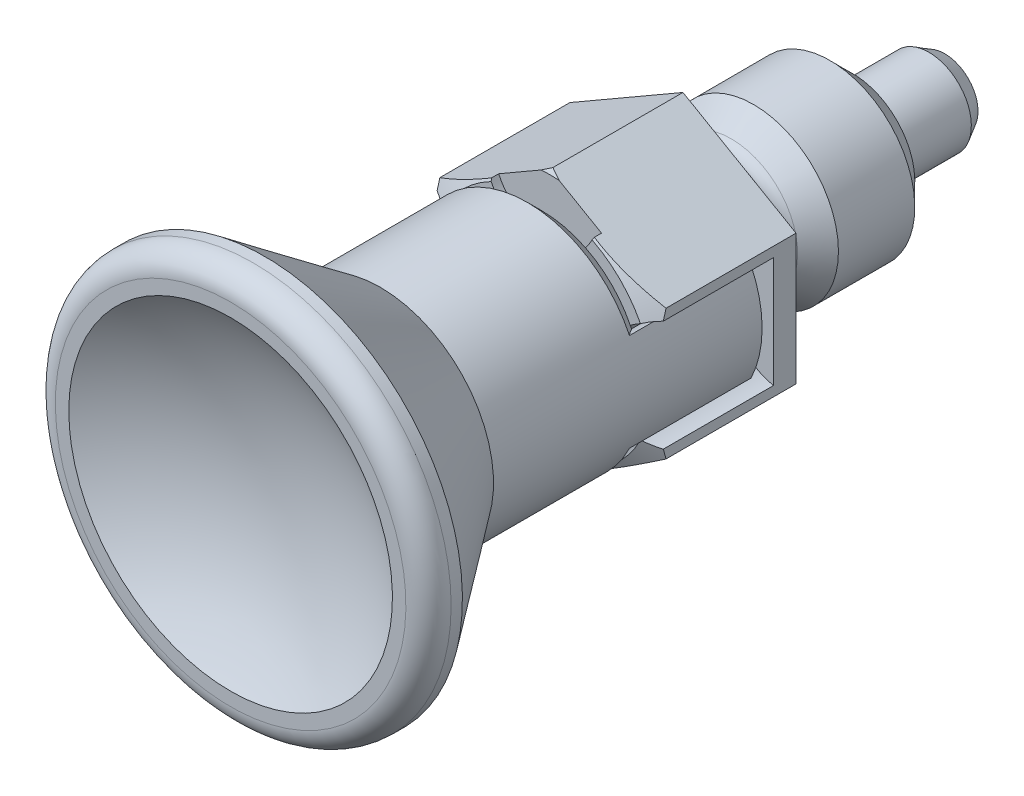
ISO-10303-21;
HEADER;
FILE_DESCRIPTION(('STEP AP214'),'2;1');
FILE_NAME('part.step','',(''),(''),'','','');
FILE_SCHEMA(('AUTOMOTIVE_DESIGN { 1 0 10303 214 1 1 1 1 }'));
ENDSEC;
DATA;
#1=APPLICATION_CONTEXT('core data for automotive mechanical design processes');
#2=APPLICATION_PROTOCOL_DEFINITION('international standard','automotive_design',2000,#1);
#3=PRODUCT_CONTEXT('',#1,'mechanical');
#4=PRODUCT('Part','Part','',(#3));
#5=PRODUCT_RELATED_PRODUCT_CATEGORY('part','',(#4));
#6=PRODUCT_DEFINITION_FORMATION('','',#4);
#7=PRODUCT_DEFINITION_CONTEXT('part definition',#1,'design');
#8=PRODUCT_DEFINITION('design','',#6,#7);
#9=PRODUCT_DEFINITION_SHAPE('','',#8);
#10=(LENGTH_UNIT() NAMED_UNIT(*) SI_UNIT(.MILLI.,.METRE.));
#11=(NAMED_UNIT(*) PLANE_ANGLE_UNIT() SI_UNIT($,.RADIAN.));
#12=(NAMED_UNIT(*) SI_UNIT($,.STERADIAN.) SOLID_ANGLE_UNIT());
#13=UNCERTAINTY_MEASURE_WITH_UNIT(LENGTH_MEASURE(1.E-05),#10,'distance_accuracy_value','');
#14=(GEOMETRIC_REPRESENTATION_CONTEXT(3) GLOBAL_UNCERTAINTY_ASSIGNED_CONTEXT((#13)) GLOBAL_UNIT_ASSIGNED_CONTEXT((#10,
#11,#12)) REPRESENTATION_CONTEXT('',''));
#15=CARTESIAN_POINT('',(0.,0.,0.));
#16=DIRECTION('',(0.,0.,1.));
#17=DIRECTION('',(1.,0.,0.));
#18=AXIS2_PLACEMENT_3D('',#15,#16,#17);
#19=CARTESIAN_POINT('',(0.,0.,-6.4999999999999));
#20=DIRECTION('',(-1.,0.,0.));
#21=DIRECTION('',(0.,1.,0.));
#22=AXIS2_PLACEMENT_3D('',#19,#20,#21);
#23=SPHERICAL_SURFACE('',#22,3.00000000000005);
#24=CARTESIAN_POINT('',(0.,0.,-9.25947486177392));
#25=DIRECTION('',(0.,0.,1.));
#26=DIRECTION('',(0.,-1.,0.));
#27=AXIS2_PLACEMENT_3D('',#24,#25,#26);
#28=CIRCLE('',#27,1.176987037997);
#29=CARTESIAN_POINT('',(0.,-1.176987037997,-9.25947486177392));
#30=VERTEX_POINT('',#29);
#31=EDGE_CURVE('E18',#30,#30,#28,.T.);
#32=ORIENTED_EDGE('',*,*,#31,.F.);
#33=EDGE_LOOP('',(#32));
#34=FACE_BOUND('',#33,.T.);
#35=ADVANCED_FACE('F14',(#34),#23,.T.);
#36=CARTESIAN_POINT('',(0.,0.,-8.700000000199));
#37=DIRECTION('',(0.,0.,1.));
#38=DIRECTION('',(0.,-1.,0.));
#39=AXIS2_PLACEMENT_3D('',#36,#37,#38);
#40=CONICAL_SURFACE('',#39,1.49999999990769,0.52359877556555);
#41=CARTESIAN_POINT('',(0.,0.,-8.7));
#42=DIRECTION('',(0.,0.,1.));
#43=DIRECTION('',(0.,-1.,0.));
#44=AXIS2_PLACEMENT_3D('',#41,#42,#43);
#45=CIRCLE('',#44,1.5);
#46=CARTESIAN_POINT('',(0.,-1.5,-8.7));
#47=VERTEX_POINT('',#46);
#48=EDGE_CURVE('E548',#47,#47,#45,.T.);
#49=ORIENTED_EDGE('',*,*,#48,.F.);
#50=EDGE_LOOP('',(#49));
#51=FACE_BOUND('',#50,.T.);
#52=ORIENTED_EDGE('',*,*,#31,.T.);
#53=EDGE_LOOP('',(#52));
#54=FACE_BOUND('',#53,.T.);
#55=ADVANCED_FACE('F1201',(#51,#54),#40,.T.);
#56=CARTESIAN_POINT('',(0.,0.,-9.5));
#57=DIRECTION('',(0.,0.,1.));
#58=DIRECTION('',(0.,-1.,0.));
#59=AXIS2_PLACEMENT_3D('',#56,#57,#58);
#60=CYLINDRICAL_SURFACE('',#59,1.5);
#61=CARTESIAN_POINT('',(0.,0.,-6.));
#62=DIRECTION('',(0.,0.,1.));
#63=DIRECTION('',(0.,-1.,0.));
#64=AXIS2_PLACEMENT_3D('',#61,#62,#63);
#65=CIRCLE('',#64,1.5);
#66=CARTESIAN_POINT('',(0.,-1.5,-6.));
#67=VERTEX_POINT('',#66);
#68=EDGE_CURVE('E551',#67,#67,#65,.F.);
#69=ORIENTED_EDGE('',*,*,#68,.T.);
#70=EDGE_LOOP('',(#69));
#71=FACE_BOUND('',#70,.T.);
#72=ORIENTED_EDGE('',*,*,#48,.T.);
#73=EDGE_LOOP('',(#72));
#74=FACE_BOUND('',#73,.T.);
#75=ADVANCED_FACE('F1192',(#71,#74),#60,.T.);
#76=CARTESIAN_POINT('',(2.2,0.,-6.));
#77=DIRECTION('',(0.,0.,1.));
#78=DIRECTION('',(0.,-1.,0.));
#79=AXIS2_PLACEMENT_3D('',#76,#77,#78);
#80=PLANE('',#79);
#81=CARTESIAN_POINT('',(0.,0.,-6.0000000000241));
#82=DIRECTION('',(0.,0.,1.));
#83=DIRECTION('',(0.,-1.,0.));
#84=AXIS2_PLACEMENT_3D('',#81,#82,#83);
#85=CIRCLE('',#84,2.19999999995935);
#86=CARTESIAN_POINT('',(0.,-2.19999999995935,-6.0000000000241));
#87=VERTEX_POINT('',#86);
#88=EDGE_CURVE('E545',#87,#87,#85,.T.);
#89=ORIENTED_EDGE('',*,*,#88,.F.);
#90=EDGE_LOOP('',(#89));
#91=FACE_BOUND('',#90,.T.);
#92=ORIENTED_EDGE('',*,*,#68,.F.);
#93=EDGE_LOOP('',(#92));
#94=FACE_BOUND('',#93,.T.);
#95=ADVANCED_FACE('F1183',(#91,#94),#80,.F.);
#96=CARTESIAN_POINT('',(0.,0.,-5.20000000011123));
#97=DIRECTION('',(0.,0.,1.));
#98=DIRECTION('',(0.,-1.,0.));
#99=AXIS2_PLACEMENT_3D('',#96,#97,#98);
#100=CONICAL_SURFACE('',#99,2.99999999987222,0.785398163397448);
#101=CARTESIAN_POINT('',(0.,0.,-5.2));
#102=DIRECTION('',(0.,0.,1.));
#103=DIRECTION('',(0.,-1.,0.));
#104=AXIS2_PLACEMENT_3D('',#101,#102,#103);
#105=CIRCLE('',#104,3.);
#106=CARTESIAN_POINT('',(0.,-3.,-5.2));
#107=VERTEX_POINT('',#106);
#108=EDGE_CURVE('E540',#107,#107,#105,.T.);
#109=ORIENTED_EDGE('',*,*,#108,.F.);
#110=EDGE_LOOP('',(#109));
#111=FACE_BOUND('',#110,.T.);
#112=ORIENTED_EDGE('',*,*,#88,.T.);
#113=EDGE_LOOP('',(#112));
#114=FACE_BOUND('',#113,.T.);
#115=ADVANCED_FACE('F1175',(#111,#114),#100,.T.);
#116=CARTESIAN_POINT('',(0.,0.,-6.));
#117=DIRECTION('',(0.,0.,1.));
#118=DIRECTION('',(0.,-1.,0.));
#119=AXIS2_PLACEMENT_3D('',#116,#117,#118);
#120=CYLINDRICAL_SURFACE('',#119,3.);
#121=CARTESIAN_POINT('',(0.,0.,-2.49999999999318));
#122=DIRECTION('',(0.,0.,-1.));
#123=DIRECTION('',(0.,1.,0.));
#124=AXIS2_PLACEMENT_3D('',#121,#122,#123);
#125=CIRCLE('',#124,2.99999999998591);
#126=CARTESIAN_POINT('',(0.,2.99999999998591,-2.49999999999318));
#127=VERTEX_POINT('',#126);
#128=EDGE_CURVE('E535',#127,#127,#125,.F.);
#129=ORIENTED_EDGE('',*,*,#128,.F.);
#130=EDGE_LOOP('',(#129));
#131=FACE_BOUND('',#130,.T.);
#132=ORIENTED_EDGE('',*,*,#108,.T.);
#133=EDGE_LOOP('',(#132));
#134=FACE_BOUND('',#133,.T.);
#135=ADVANCED_FACE('F1167',(#131,#134),#120,.T.);
#136=CARTESIAN_POINT('',(0.,0.,-2.49999999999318));
#137=DIRECTION('',(0.,0.,-1.));
#138=DIRECTION('',(0.,1.,0.));
#139=AXIS2_PLACEMENT_3D('',#136,#137,#138);
#140=CONICAL_SURFACE('',#139,2.99999999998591,0.698131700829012);
#141=CARTESIAN_POINT('',(0.,0.,-1.71388755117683));
#142=DIRECTION('',(0.,0.,-1.));
#143=DIRECTION('',(0.,1.,0.));
#144=AXIS2_PLACEMENT_3D('',#141,#142,#143);
#145=CIRCLE('',#144,2.34037333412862);
#146=CARTESIAN_POINT('',(0.,2.34037333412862,-1.71388755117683));
#147=VERTEX_POINT('',#146);
#148=EDGE_CURVE('E497',#147,#147,#145,.T.);
#149=ORIENTED_EDGE('',*,*,#148,.T.);
#150=EDGE_LOOP('',(#149));
#151=FACE_BOUND('',#150,.T.);
#152=ORIENTED_EDGE('',*,*,#128,.T.);
#153=EDGE_LOOP('',(#152));
#154=FACE_BOUND('',#153,.T.);
#155=ADVANCED_FACE('F527',(#151,#154),#140,.T.);
#156=CARTESIAN_POINT('',(0.,0.,-1.32821498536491));
#157=DIRECTION('',(0.,0.,-1.));
#158=DIRECTION('',(0.,1.,0.));
#159=AXIS2_PLACEMENT_3D('',#156,#157,#158);
#160=TOROIDAL_SURFACE('',#159,2.8,0.6);
#161=CARTESIAN_POINT('',(0.,0.,-1.32821498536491));
#162=DIRECTION('',(0.,0.,1.));
#163=DIRECTION('',(0.,-1.,0.));
#164=AXIS2_PLACEMENT_3D('',#161,#162,#163);
#165=CIRCLE('',#164,2.2);
#166=CARTESIAN_POINT('',(0.,-2.2,-1.32821498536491));
#167=VERTEX_POINT('',#166);
#168=EDGE_CURVE('E492',#167,#167,#165,.T.);
#169=ORIENTED_EDGE('',*,*,#168,.F.);
#170=EDGE_LOOP('',(#169));
#171=FACE_BOUND('',#170,.T.);
#172=ORIENTED_EDGE('',*,*,#148,.F.);
#173=EDGE_LOOP('',(#172));
#174=FACE_BOUND('',#173,.T.);
#175=ADVANCED_FACE('F523',(#171,#174),#160,.F.);
#176=CARTESIAN_POINT('',(0.,0.,-6.));
#177=DIRECTION('',(0.,0.,1.));
#178=DIRECTION('',(0.,-1.,0.));
#179=AXIS2_PLACEMENT_3D('',#176,#177,#178);
#180=CYLINDRICAL_SURFACE('',#179,2.2);
#181=CARTESIAN_POINT('',(0.,0.,-0.6));
#182=DIRECTION('',(0.,0.,-1.));
#183=DIRECTION('',(0.,1.,0.));
#184=AXIS2_PLACEMENT_3D('',#181,#182,#183);
#185=CIRCLE('',#184,2.2);
#186=CARTESIAN_POINT('',(0.,2.2,-0.6));
#187=VERTEX_POINT('',#186);
#188=EDGE_CURVE('E487',#187,#187,#185,.T.);
#189=ORIENTED_EDGE('',*,*,#188,.T.);
#190=EDGE_LOOP('',(#189));
#191=FACE_BOUND('',#190,.T.);
#192=ORIENTED_EDGE('',*,*,#168,.T.);
#193=EDGE_LOOP('',(#192));
#194=FACE_BOUND('',#193,.T.);
#195=ADVANCED_FACE('F520',(#191,#194),#180,.T.);
#196=CARTESIAN_POINT('',(0.,0.,-0.6));
#197=DIRECTION('',(0.,0.,-1.));
#198=DIRECTION('',(0.,1.,0.));
#199=AXIS2_PLACEMENT_3D('',#196,#197,#198);
#200=TOROIDAL_SURFACE('',#199,2.8,0.6);
#201=CARTESIAN_POINT('',(0.,0.,0.));
#202=DIRECTION('',(0.,0.,-1.));
#203=DIRECTION('',(0.,1.,0.));
#204=AXIS2_PLACEMENT_3D('',#201,#202,#203);
#205=CIRCLE('',#204,2.8);
#206=CARTESIAN_POINT('',(0.,2.8,0.));
#207=VERTEX_POINT('',#206);
#208=EDGE_CURVE('E483',#207,#207,#205,.T.);
#209=ORIENTED_EDGE('',*,*,#208,.T.);
#210=EDGE_LOOP('',(#209));
#211=FACE_BOUND('',#210,.T.);
#212=ORIENTED_EDGE('',*,*,#188,.F.);
#213=EDGE_LOOP('',(#212));
#214=FACE_BOUND('',#213,.T.);
#215=ADVANCED_FACE('F509',(#211,#214),#200,.F.);
#216=CARTESIAN_POINT('',(0.,0.,4.59940000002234));
#217=DIRECTION('',(0.,0.,-1.));
#218=DIRECTION('',(0.,1.,0.));
#219=AXIS2_PLACEMENT_3D('',#216,#217,#218);
#220=CONICAL_SURFACE('',#219,4.61984138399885,1.04719755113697);
#221=CARTESIAN_POINT('',(0.,4.618802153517,4.6));
#222=CARTESIAN_POINT('',(0.163042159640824,4.52466971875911,4.65434738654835));
#223=CARTESIAN_POINT('',(0.319970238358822,4.43406725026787,4.7));
#224=B_SPLINE_CURVE_WITH_KNOTS('',2,(#221,#222,#223),.UNSPECIFIED.,.F.,.F.,(3,3),(0.,1.),.UNSPECIFIED.);
#225=CARTESIAN_POINT('',(0.,4.61880215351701,4.6));
#226=VERTEX_POINT('',#225);
#227=CARTESIAN_POINT('',(0.319970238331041,4.43406725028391,4.70000000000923));
#228=VERTEX_POINT('',#227);
#229=EDGE_CURVE('E197',#226,#228,#224,.T.);
#230=ORIENTED_EDGE('',*,*,#229,.F.);
#231=CARTESIAN_POINT('',(-0.319970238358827,4.43406725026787,4.7));
#232=CARTESIAN_POINT('',(-0.163042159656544,4.52466971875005,4.65434738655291));
#233=CARTESIAN_POINT('',(0.,4.61880215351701,4.6));
#234=B_SPLINE_CURVE_WITH_KNOTS('',2,(#231,#232,#233),.UNSPECIFIED.,.F.,.F.,(3,3),(0.,1.),.UNSPECIFIED.);
#235=CARTESIAN_POINT('',(-0.319970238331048,4.43406725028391,4.70000000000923));
#236=VERTEX_POINT('',#235);
#237=EDGE_CURVE('E281',#236,#226,#234,.T.);
#238=ORIENTED_EDGE('',*,*,#237,.F.);
#239=CARTESIAN_POINT('',(0.,0.,4.70000000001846));
#240=DIRECTION('',(0.,0.,-1.));
#241=DIRECTION('',(0.,1.,0.));
#242=AXIS2_PLACEMENT_3D('',#239,#240,#241);
#243=CIRCLE('',#242,4.44559707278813);
#244=EDGE_CURVE('E844',#228,#236,#243,.F.);
#245=ORIENTED_EDGE('',*,*,#244,.F.);
#246=EDGE_LOOP('',(#230,#238,#245));
#247=FACE_BOUND('',#246,.T.);
#248=ADVANCED_FACE('F519',(#247),#220,.T.);
#249=CARTESIAN_POINT('',(0.,0.,4.59940000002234));
#250=DIRECTION('',(0.,0.,-1.));
#251=DIRECTION('',(0.,1.,0.));
#252=AXIS2_PLACEMENT_3D('',#249,#250,#251);
#253=CONICAL_SURFACE('',#252,4.61984138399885,1.04719755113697);
#254=CARTESIAN_POINT('',(0.,-4.61880215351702,4.6));
#255=CARTESIAN_POINT('',(-0.163042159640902,-4.52466971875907,4.65434738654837));
#256=CARTESIAN_POINT('',(-0.319970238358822,-4.43406725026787,4.7));
#257=B_SPLINE_CURVE_WITH_KNOTS('',2,(#254,#255,#256),.UNSPECIFIED.,.F.,.F.,(3,3),(0.,1.),.UNSPECIFIED.);
#258=CARTESIAN_POINT('',(0.,-4.61880215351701,4.6));
#259=VERTEX_POINT('',#258);
#260=CARTESIAN_POINT('',(-0.319970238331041,-4.43406725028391,4.70000000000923));
#261=VERTEX_POINT('',#260);
#262=EDGE_CURVE('E241',#259,#261,#257,.T.);
#263=ORIENTED_EDGE('',*,*,#262,.F.);
#264=CARTESIAN_POINT('',(0.319970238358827,-4.43406725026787,4.7));
#265=CARTESIAN_POINT('',(0.163042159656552,-4.52466971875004,4.65434738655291));
#266=CARTESIAN_POINT('',(0.,-4.618802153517,4.6));
#267=B_SPLINE_CURVE_WITH_KNOTS('',2,(#264,#265,#266),.UNSPECIFIED.,.F.,.F.,(3,3),(0.,1.),.UNSPECIFIED.);
#268=CARTESIAN_POINT('',(0.319970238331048,-4.43406725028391,4.70000000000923));
#269=VERTEX_POINT('',#268);
#270=EDGE_CURVE('E688',#269,#259,#267,.T.);
#271=ORIENTED_EDGE('',*,*,#270,.F.);
#272=CARTESIAN_POINT('',(0.,0.,4.70000000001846));
#273=DIRECTION('',(0.,0.,-1.));
#274=DIRECTION('',(0.,1.,0.));
#275=AXIS2_PLACEMENT_3D('',#272,#273,#274);
#276=CIRCLE('',#275,4.44559707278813);
#277=EDGE_CURVE('E465',#261,#269,#276,.F.);
#278=ORIENTED_EDGE('',*,*,#277,.F.);
#279=EDGE_LOOP('',(#263,#271,#278));
#280=FACE_BOUND('',#279,.T.);
#281=ADVANCED_FACE('F739',(#280),#253,.T.);
#282=CARTESIAN_POINT('',(13.,0.,0.));
#283=DIRECTION('',(0.,0.,1.));
#284=DIRECTION('',(0.,-1.,0.));
#285=AXIS2_PLACEMENT_3D('',#282,#283,#284);
#286=PLANE('',#285);
#287=DIRECTION('',(-0.866025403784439,0.5,0.));
#288=VECTOR('',#287,1.);
#289=CARTESIAN_POINT('',(4.,2.3094010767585,0.));
#290=LINE('',#289,#288);
#291=CARTESIAN_POINT('',(4.,2.3094010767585,0.));
#292=VERTEX_POINT('',#291);
#293=CARTESIAN_POINT('',(0.,4.61880215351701,0.));
#294=VERTEX_POINT('',#293);
#295=EDGE_CURVE('E205',#292,#294,#290,.T.);
#296=ORIENTED_EDGE('',*,*,#295,.F.);
#297=DIRECTION('',(0.,1.,0.));
#298=VECTOR('',#297,1.);
#299=CARTESIAN_POINT('',(4.,-2.3094010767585,0.));
#300=LINE('',#299,#298);
#301=CARTESIAN_POINT('',(4.,-2.3094010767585,0.));
#302=VERTEX_POINT('',#301);
#303=EDGE_CURVE('E681',#302,#292,#300,.T.);
#304=ORIENTED_EDGE('',*,*,#303,.F.);
#305=DIRECTION('',(0.866025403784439,0.5,0.));
#306=VECTOR('',#305,1.);
#307=CARTESIAN_POINT('',(0.,-4.61880215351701,0.));
#308=LINE('',#307,#306);
#309=CARTESIAN_POINT('',(0.,-4.618802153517,0.));
#310=VERTEX_POINT('',#309);
#311=EDGE_CURVE('E218',#310,#302,#308,.T.);
#312=ORIENTED_EDGE('',*,*,#311,.F.);
#313=DIRECTION('',(0.866025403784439,-0.5,0.));
#314=VECTOR('',#313,1.);
#315=CARTESIAN_POINT('',(-4.,-2.3094010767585,0.));
#316=LINE('',#315,#314);
#317=CARTESIAN_POINT('',(-4.,-2.3094010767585,0.));
#318=VERTEX_POINT('',#317);
#319=EDGE_CURVE('E236',#318,#310,#316,.T.);
#320=ORIENTED_EDGE('',*,*,#319,.F.);
#321=DIRECTION('',(0.,-1.,0.));
#322=VECTOR('',#321,1.);
#323=CARTESIAN_POINT('',(-4.,2.3094010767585,0.));
#324=LINE('',#323,#322);
#325=CARTESIAN_POINT('',(-4.,2.3094010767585,0.));
#326=VERTEX_POINT('',#325);
#327=EDGE_CURVE('E226',#326,#318,#324,.T.);
#328=ORIENTED_EDGE('',*,*,#327,.F.);
#329=DIRECTION('',(-0.866025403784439,-0.5,0.));
#330=VECTOR('',#329,1.);
#331=CARTESIAN_POINT('',(0.,4.61880215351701,0.));
#332=LINE('',#331,#330);
#333=EDGE_CURVE('E833',#294,#326,#332,.T.);
#334=ORIENTED_EDGE('',*,*,#333,.F.);
#335=EDGE_LOOP('',(#296,#304,#312,#320,#328,#334));
#336=FACE_BOUND('',#335,.T.);
#337=ORIENTED_EDGE('',*,*,#208,.F.);
#338=EDGE_LOOP('',(#337));
#339=FACE_BOUND('',#338,.T.);
#340=ADVANCED_FACE('F237',(#336,#339),#286,.F.);
#341=CARTESIAN_POINT('',(4.,2.3094010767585,0.));
#342=DIRECTION('',(0.5,0.866025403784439,0.));
#343=DIRECTION('',(-0.866025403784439,0.5,0.));
#344=AXIS2_PLACEMENT_3D('',#341,#342,#343);
#345=PLANE('',#344);
#346=ORIENTED_EDGE('',*,*,#229,.T.);
#347=DIRECTION('',(-0.86602540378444,0.5,0.));
#348=VECTOR('',#347,1.);
#349=CARTESIAN_POINT('',(1.81900356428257,3.56859995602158,4.7));
#350=LINE('',#349,#348);
#351=CARTESIAN_POINT('',(1.81900356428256,3.56859995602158,4.7));
#352=VERTEX_POINT('',#351);
#353=EDGE_CURVE('E476',#352,#228,#350,.T.);
#354=ORIENTED_EDGE('',*,*,#353,.F.);
#355=DIRECTION('',(0.,0.,1.));
#356=VECTOR('',#355,1.);
#357=CARTESIAN_POINT('',(1.81900356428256,3.56859995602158,0.));
#358=LINE('',#357,#356);
#359=CARTESIAN_POINT('',(1.81900356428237,3.56859995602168,4.9541154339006));
#360=VERTEX_POINT('',#359);
#361=EDGE_CURVE('E477',#352,#360,#358,.T.);
#362=ORIENTED_EDGE('',*,*,#361,.T.);
#363=CARTESIAN_POINT('',(4.00000002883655,2.30940106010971,4.59999999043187));
#364=CARTESIAN_POINT('',(3.82263966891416,2.41180011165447,4.65915212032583));
#365=CARTESIAN_POINT('',(3.64369188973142,2.51511566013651,4.71289110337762));
#366=CARTESIAN_POINT('',(3.28423717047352,2.72264693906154,4.80611761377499));
#367=CARTESIAN_POINT('',(3.10374695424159,2.82685301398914,4.8456920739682));
#368=CARTESIAN_POINT('',(2.83123619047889,2.98418717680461,4.89243378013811));
#369=CARTESIAN_POINT('',(2.740029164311,3.03684557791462,4.9059167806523));
#370=CARTESIAN_POINT('',(2.55719544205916,3.14240467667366,4.92834848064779));
#371=CARTESIAN_POINT('',(2.46556875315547,3.19530537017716,4.93729725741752));
#372=CARTESIAN_POINT('',(2.28148710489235,3.30158495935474,4.95046029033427));
#373=CARTESIAN_POINT('',(2.18903053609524,3.35496478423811,4.95464479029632));
#374=CARTESIAN_POINT('',(2.00402966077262,3.46177508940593,4.95809347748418));
#375=CARTESIAN_POINT('',(1.91148533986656,3.51520557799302,4.95735662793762));
#376=CARTESIAN_POINT('',(1.81900356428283,3.56859995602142,4.95411543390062));
#377=B_SPLINE_CURVE_WITH_KNOTS('',3,(#363,#364,#365,#366,#367,#368,#369,#370,#371,#372,#373,
#374,#375,#376),.UNSPECIFIED.,.F.,.F.,(4,2,2,2,2,2,4),(0.,0.639848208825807,1.27569923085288,
1.5941382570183,1.91257185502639,2.23298356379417,2.55346277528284),.UNSPECIFIED.);
#378=CARTESIAN_POINT('',(4.00000001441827,2.30940106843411,4.59999999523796));
#379=VERTEX_POINT('',#378);
#380=EDGE_CURVE('E458',#379,#360,#377,.T.);
#381=ORIENTED_EDGE('',*,*,#380,.F.);
#382=DIRECTION('',(0.,0.,1.));
#383=VECTOR('',#382,1.);
#384=CARTESIAN_POINT('',(4.,2.3094010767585,0.));
#385=LINE('',#384,#383);
#386=EDGE_CURVE('E679',#292,#379,#385,.T.);
#387=ORIENTED_EDGE('',*,*,#386,.F.);
#388=ORIENTED_EDGE('',*,*,#295,.T.);
#389=DIRECTION('',(0.,0.,1.));
#390=VECTOR('',#389,1.);
#391=CARTESIAN_POINT('',(0.,4.61880215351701,0.));
#392=LINE('',#391,#390);
#393=EDGE_CURVE('E845',#226,#294,#392,.F.);
#394=ORIENTED_EDGE('',*,*,#393,.F.);
#395=EDGE_LOOP('',(#346,#354,#362,#381,#387,#388,#394));
#396=FACE_BOUND('',#395,.T.);
#397=ADVANCED_FACE('F467',(#396),#345,.T.);
#398=CARTESIAN_POINT('',(0.,0.,4.7));
#399=DIRECTION('',(0.,0.,1.));
#400=DIRECTION('',(0.,-1.,0.));
#401=AXIS2_PLACEMENT_3D('',#398,#399,#400);
#402=PLANE('',#401);
#403=ORIENTED_EDGE('',*,*,#244,.T.);
#404=DIRECTION('',(-0.866025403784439,-0.5,0.));
#405=VECTOR('',#404,1.);
#406=CARTESIAN_POINT('',(0.,4.61880215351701,4.7));
#407=LINE('',#406,#405);
#408=CARTESIAN_POINT('',(-1.81900356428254,3.56859995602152,4.7));
#409=VERTEX_POINT('',#408);
#410=EDGE_CURVE('E843',#409,#236,#407,.F.);
#411=ORIENTED_EDGE('',*,*,#410,.F.);
#412=CARTESIAN_POINT('',(0.,4.4,4.7));
#413=DIRECTION('',(0.,0.,-1.));
#414=DIRECTION('',(0.,1.,0.));
#415=AXIS2_PLACEMENT_3D('',#412,#413,#414);
#416=CIRCLE('',#415,2.);
#417=EDGE_CURVE('E456',#409,#352,#416,.F.);
#418=ORIENTED_EDGE('',*,*,#417,.T.);
#419=ORIENTED_EDGE('',*,*,#353,.T.);
#420=EDGE_LOOP('',(#403,#411,#418,#419));
#421=FACE_BOUND('',#420,.T.);
#422=ADVANCED_FACE('F276',(#421),#402,.T.);
#423=CARTESIAN_POINT('',(0.,4.61880215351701,0.));
#424=DIRECTION('',(-0.5,0.866025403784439,0.));
#425=DIRECTION('',(-0.866025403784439,-0.5,0.));
#426=AXIS2_PLACEMENT_3D('',#423,#424,#425);
#427=PLANE('',#426);
#428=DIRECTION('',(0.,0.,1.));
#429=VECTOR('',#428,1.);
#430=CARTESIAN_POINT('',(-4.,2.3094010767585,0.));
#431=LINE('',#430,#429);
#432=CARTESIAN_POINT('',(-4.00000000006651,2.30940086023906,4.60000006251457));
#433=VERTEX_POINT('',#432);
#434=EDGE_CURVE('E233',#433,#326,#431,.F.);
#435=ORIENTED_EDGE('',*,*,#434,.F.);
#436=CARTESIAN_POINT('',(-1.81900357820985,3.56859994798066,4.95411543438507));
#437=CARTESIAN_POINT('',(-1.89797597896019,3.5230052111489,4.95687539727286));
#438=CARTESIAN_POINT('',(-1.97699450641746,3.47738384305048,4.95781859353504));
#439=CARTESIAN_POINT('',(-2.13499326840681,3.3861632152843,4.95610923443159));
#440=CARTESIAN_POINT('',(-2.21397350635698,3.34056395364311,4.9534571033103));
#441=CARTESIAN_POINT('',(-2.37167820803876,3.24951310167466,4.94460143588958));
#442=CARTESIAN_POINT('',(-2.45040287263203,3.20406139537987,4.93840265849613));
#443=CARTESIAN_POINT('',(-2.60759133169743,3.11330859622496,4.92258404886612));
#444=CARTESIAN_POINT('',(-2.68605512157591,3.06800750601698,4.91296415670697));
#445=CARTESIAN_POINT('',(-2.91952974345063,2.93321087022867,4.87942233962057));
#446=CARTESIAN_POINT('',(-3.07403813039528,2.84400541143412,4.85073293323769));
#447=CARTESIAN_POINT('',(-3.38118921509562,2.66667165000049,4.78234456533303));
#448=CARTESIAN_POINT('',(-3.53383173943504,2.57854344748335,4.74264458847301));
#449=CARTESIAN_POINT('',(-3.7380796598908,2.46062085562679,4.68307028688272));
#450=CARTESIAN_POINT('',(-3.79058026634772,2.43030961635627,4.66717624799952));
#451=CARTESIAN_POINT('',(-3.89542620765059,2.36977678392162,4.63434653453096));
#452=CARTESIAN_POINT('',(-3.94777116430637,2.33955540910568,4.61740924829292));
#453=CARTESIAN_POINT('',(-4.00000002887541,2.30940106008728,4.59999999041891));
#454=B_SPLINE_CURVE_WITH_KNOTS('',3,(#436,#437,#438,#439,#440,#441,#442,#443,#444,#445,#446,
#447,#448,#449,#450,#451,#452,#453),.UNSPECIFIED.,.F.,.F.,(4,2,2,2,2,2,2,2,4),(0.,
0.273673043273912,0.54731379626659,0.820588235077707,1.09386746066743,1.63553198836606,
2.17724648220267,2.36525509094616,2.55356180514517),.UNSPECIFIED.);
#455=CARTESIAN_POINT('',(-1.81900357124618,3.56859995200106,4.95411543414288));
#456=VERTEX_POINT('',#455);
#457=EDGE_CURVE('E285',#456,#433,#454,.T.);
#458=ORIENTED_EDGE('',*,*,#457,.F.);
#459=DIRECTION('',(0.,0.,-1.));
#460=VECTOR('',#459,1.);
#461=CARTESIAN_POINT('',(-1.8190035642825,3.56859995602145,4.7));
#462=LINE('',#461,#460);
#463=EDGE_CURVE('E838',#456,#409,#462,.T.);
#464=ORIENTED_EDGE('',*,*,#463,.T.);
#465=ORIENTED_EDGE('',*,*,#410,.T.);
#466=ORIENTED_EDGE('',*,*,#237,.T.);
#467=ORIENTED_EDGE('',*,*,#393,.T.);
#468=ORIENTED_EDGE('',*,*,#333,.T.);
#469=EDGE_LOOP('',(#435,#458,#464,#465,#466,#467,#468));
#470=FACE_BOUND('',#469,.T.);
#471=ADVANCED_FACE('F271',(#470),#427,.T.);
#472=CARTESIAN_POINT('',(0.,0.,0.8));
#473=DIRECTION('',(0.,0.,1.));
#474=DIRECTION('',(0.,-1.,0.));
#475=AXIS2_PLACEMENT_3D('',#472,#473,#474);
#476=PLANE('',#475);
#477=CARTESIAN_POINT('',(-4.4,0.,0.8));
#478=DIRECTION('',(0.,0.,-1.));
#479=DIRECTION('',(0.,1.,0.));
#480=AXIS2_PLACEMENT_3D('',#477,#478,#479);
#481=CIRCLE('',#480,2.);
#482=CARTESIAN_POINT('',(-4.,-1.95959179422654,0.8));
#483=VERTEX_POINT('',#482);
#484=CARTESIAN_POINT('',(-4.,1.95959179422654,0.8));
#485=VERTEX_POINT('',#484);
#486=EDGE_CURVE('E296',#483,#485,#481,.F.);
#487=ORIENTED_EDGE('',*,*,#486,.T.);
#488=DIRECTION('',(0.,-1.,0.));
#489=VECTOR('',#488,1.);
#490=CARTESIAN_POINT('',(-4.,2.3094010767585,0.8));
#491=LINE('',#490,#489);
#492=EDGE_CURVE('E831',#483,#485,#491,.F.);
#493=ORIENTED_EDGE('',*,*,#492,.F.);
#494=EDGE_LOOP('',(#487,#493));
#495=FACE_BOUND('',#494,.T.);
#496=ADVANCED_FACE('F266',(#495),#476,.T.);
#497=CARTESIAN_POINT('',(-4.,2.3094010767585,0.));
#498=DIRECTION('',(-1.,0.,0.));
#499=DIRECTION('',(0.,-1.,0.));
#500=AXIS2_PLACEMENT_3D('',#497,#498,#499);
#501=PLANE('',#500);
#502=DIRECTION('',(0.,0.,1.));
#503=VECTOR('',#502,1.);
#504=CARTESIAN_POINT('',(-4.,-2.3094010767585,0.));
#505=LINE('',#504,#503);
#506=CARTESIAN_POINT('',(-4.,-2.3094010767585,4.60000000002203));
#507=VERTEX_POINT('',#506);
#508=EDGE_CURVE('E230',#507,#318,#505,.F.);
#509=ORIENTED_EDGE('',*,*,#508,.F.);
#510=CARTESIAN_POINT('',(-4.,-2.3094010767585,4.6));
#511=CARTESIAN_POINT('',(-4.,-2.13132354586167,4.65140655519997));
#512=CARTESIAN_POINT('',(-4.,-1.95959179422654,4.69502646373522));
#513=B_SPLINE_CURVE_WITH_KNOTS('',2,(#510,#511,#512),.UNSPECIFIED.,.F.,.F.,(3,3),(0.,1.),.UNSPECIFIED.);
#514=CARTESIAN_POINT('',(-4.,-1.95959179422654,4.69502646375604));
#515=VERTEX_POINT('',#514);
#516=EDGE_CURVE('E234',#507,#515,#513,.T.);
#517=ORIENTED_EDGE('',*,*,#516,.T.);
#518=DIRECTION('',(0.,0.,-1.));
#519=VECTOR('',#518,1.);
#520=CARTESIAN_POINT('',(-4.,-1.95959179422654,0.8));
#521=LINE('',#520,#519);
#522=EDGE_CURVE('E294',#515,#483,#521,.T.);
#523=ORIENTED_EDGE('',*,*,#522,.T.);
#524=ORIENTED_EDGE('',*,*,#492,.T.);
#525=DIRECTION('',(0.,0.,-1.));
#526=VECTOR('',#525,1.);
#527=CARTESIAN_POINT('',(-4.,1.95959179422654,0.8));
#528=LINE('',#527,#526);
#529=CARTESIAN_POINT('',(-3.9999999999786,1.95959184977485,4.69502644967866));
#530=VERTEX_POINT('',#529);
#531=EDGE_CURVE('E330',#485,#530,#528,.F.);
#532=ORIENTED_EDGE('',*,*,#531,.T.);
#533=CARTESIAN_POINT('',(-4.000000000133,2.30940064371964,4.60000012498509));
#534=CARTESIAN_POINT('',(-3.99999999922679,2.29469556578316,4.60424511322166));
#535=CARTESIAN_POINT('',(-3.99999997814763,2.27998238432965,4.6084620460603));
#536=CARTESIAN_POINT('',(-3.99999991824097,2.25059795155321,4.61682216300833));
#537=CARTESIAN_POINT('',(-3.99999987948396,2.23592676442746,4.62096557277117));
#538=CARTESIAN_POINT('',(-3.99999980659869,2.20662505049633,4.62917864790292));
#539=CARTESIAN_POINT('',(-3.99999977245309,2.19199458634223,4.63324853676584));
#540=CARTESIAN_POINT('',(-3.99999972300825,2.16277302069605,4.64131457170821));
#541=CARTESIAN_POINT('',(-3.99999970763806,2.14818198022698,4.64531093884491));
#542=CARTESIAN_POINT('',(-3.99999970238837,2.1190379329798,4.65322993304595));
#543=CARTESIAN_POINT('',(-3.99999971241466,2.10448498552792,4.65715277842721));
#544=CARTESIAN_POINT('',(-3.9999997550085,2.07541576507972,4.66492473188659));
#545=CARTESIAN_POINT('',(-3.99999978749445,2.06089954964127,4.66877405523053));
#546=CARTESIAN_POINT('',(-3.99999986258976,2.03190240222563,4.67639896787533));
#547=CARTESIAN_POINT('',(-3.99999990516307,2.01742152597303,4.68017476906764));
#548=CARTESIAN_POINT('',(-3.99999997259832,1.98849363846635,4.68765264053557));
#549=CARTESIAN_POINT('',(-3.9999999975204,1.97404668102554,4.69135491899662));
#550=CARTESIAN_POINT('',(-3.9999999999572,1.95959190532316,4.69502643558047));
#551=B_SPLINE_CURVE_WITH_KNOTS('',3,(#533,#534,#535,#536,#537,#538,#539,#540,#541,#542,#543,
#544,#545,#546,#547,#548,#549,#550),.UNSPECIFIED.,.F.,.F.,(4,2,2,2,2,2,2,2,4),(0.,
0.0459165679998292,0.0916516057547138,0.13720947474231,0.182594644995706,0.227811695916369,
0.272865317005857,0.317760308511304,0.362501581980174),.UNSPECIFIED.);
#552=EDGE_CURVE('E318',#433,#530,#551,.T.);
#553=ORIENTED_EDGE('',*,*,#552,.F.);
#554=ORIENTED_EDGE('',*,*,#434,.T.);
#555=ORIENTED_EDGE('',*,*,#327,.T.);
#556=EDGE_LOOP('',(#509,#517,#523,#524,#532,#553,#554,#555));
#557=FACE_BOUND('',#556,.T.);
#558=ADVANCED_FACE('F228',(#557),#501,.T.);
#559=CARTESIAN_POINT('',(-4.,-2.3094010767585,0.));
#560=DIRECTION('',(-0.5,-0.866025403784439,0.));
#561=DIRECTION('',(0.866025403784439,-0.5,0.));
#562=AXIS2_PLACEMENT_3D('',#559,#560,#561);
#563=PLANE('',#562);
#564=ORIENTED_EDGE('',*,*,#262,.T.);
#565=DIRECTION('',(0.86602540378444,-0.5,0.));
#566=VECTOR('',#565,1.);
#567=CARTESIAN_POINT('',(-1.81900356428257,-3.56859995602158,4.7));
#568=LINE('',#567,#566);
#569=CARTESIAN_POINT('',(-1.81900356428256,-3.56859995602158,4.7));
#570=VERTEX_POINT('',#569);
#571=EDGE_CURVE('E730',#570,#261,#568,.T.);
#572=ORIENTED_EDGE('',*,*,#571,.F.);
#573=DIRECTION('',(0.,0.,1.));
#574=VECTOR('',#573,1.);
#575=CARTESIAN_POINT('',(-1.81900356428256,-3.56859995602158,0.));
#576=LINE('',#575,#574);
#577=CARTESIAN_POINT('',(-1.81900356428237,-3.56859995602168,4.9541154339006));
#578=VERTEX_POINT('',#577);
#579=EDGE_CURVE('E246',#570,#578,#576,.T.);
#580=ORIENTED_EDGE('',*,*,#579,.T.);
#581=CARTESIAN_POINT('',(-4.00000000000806,-2.30940107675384,4.60000000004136));
#582=CARTESIAN_POINT('',(-3.82263964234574,-2.41180012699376,4.65915212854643));
#583=CARTESIAN_POINT('',(-3.64369186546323,-2.51511567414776,4.712891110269));
#584=CARTESIAN_POINT('',(-3.28423715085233,-2.72264695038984,4.80611761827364));
#585=CARTESIAN_POINT('',(-3.10374693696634,-2.82685302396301,4.84569207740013));
#586=CARTESIAN_POINT('',(-2.83123617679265,-2.98418718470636,4.89243378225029));
#587=CARTESIAN_POINT('',(-2.74002915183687,-3.03684558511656,4.90591678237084));
#588=CARTESIAN_POINT('',(-2.55719543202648,-3.14240468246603,4.92834848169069));
#589=CARTESIAN_POINT('',(-2.46556874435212,-3.19530537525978,4.93729725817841));
#590=CARTESIAN_POINT('',(-2.28148709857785,-3.30158496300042,4.95046029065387));
#591=CARTESIAN_POINT('',(-2.18903053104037,-3.35496478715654,4.95464479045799));
#592=CARTESIAN_POINT('',(-2.00402965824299,-3.46177509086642,4.95809347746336));
#593=CARTESIAN_POINT('',(-1.91148533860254,-3.5152055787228,4.95735662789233));
#594=CARTESIAN_POINT('',(-1.81900356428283,-3.56859995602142,4.95411543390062));
#595=B_SPLINE_CURVE_WITH_KNOTS('',3,(#581,#582,#583,#584,#585,#586,#587,#588,#589,#590,#591,
#592,#593,#594),.UNSPECIFIED.,.F.,.F.,(4,2,2,2,2,2,4),(0.,0.639848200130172,1.27569921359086,
1.59413823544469,1.91257182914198,2.23298353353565,2.55346274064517),.UNSPECIFIED.);
#596=EDGE_CURVE('E245',#507,#578,#595,.T.);
#597=ORIENTED_EDGE('',*,*,#596,.F.);
#598=ORIENTED_EDGE('',*,*,#508,.T.);
#599=ORIENTED_EDGE('',*,*,#319,.T.);
#600=DIRECTION('',(0.,0.,1.));
#601=VECTOR('',#600,1.);
#602=CARTESIAN_POINT('',(0.,-4.618802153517,0.));
#603=LINE('',#602,#601);
#604=EDGE_CURVE('E693',#259,#310,#603,.F.);
#605=ORIENTED_EDGE('',*,*,#604,.F.);
#606=EDGE_LOOP('',(#564,#572,#580,#597,#598,#599,#605));
#607=FACE_BOUND('',#606,.T.);
#608=ADVANCED_FACE('F243',(#607),#563,.T.);
#609=CARTESIAN_POINT('',(0.,0.,4.7));
#610=DIRECTION('',(0.,0.,1.));
#611=DIRECTION('',(0.,-1.,0.));
#612=AXIS2_PLACEMENT_3D('',#609,#610,#611);
#613=PLANE('',#612);
#614=ORIENTED_EDGE('',*,*,#277,.T.);
#615=DIRECTION('',(0.866025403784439,0.5,0.));
#616=VECTOR('',#615,1.);
#617=CARTESIAN_POINT('',(0.,-4.61880215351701,4.7));
#618=LINE('',#617,#616);
#619=CARTESIAN_POINT('',(1.81900356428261,-3.56859995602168,4.7));
#620=VERTEX_POINT('',#619);
#621=EDGE_CURVE('E694',#620,#269,#618,.F.);
#622=ORIENTED_EDGE('',*,*,#621,.F.);
#623=CARTESIAN_POINT('',(0.,-4.4,4.7));
#624=DIRECTION('',(0.,0.,-1.));
#625=DIRECTION('',(0.,1.,0.));
#626=AXIS2_PLACEMENT_3D('',#623,#624,#625);
#627=CIRCLE('',#626,2.);
#628=EDGE_CURVE('E362',#620,#570,#627,.F.);
#629=ORIENTED_EDGE('',*,*,#628,.T.);
#630=ORIENTED_EDGE('',*,*,#571,.T.);
#631=EDGE_LOOP('',(#614,#622,#629,#630));
#632=FACE_BOUND('',#631,.T.);
#633=ADVANCED_FACE('F705',(#632),#613,.T.);
#634=CARTESIAN_POINT('',(0.,-4.61880215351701,0.));
#635=DIRECTION('',(0.5,-0.866025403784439,0.));
#636=DIRECTION('',(0.866025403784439,0.5,0.));
#637=AXIS2_PLACEMENT_3D('',#634,#635,#636);
#638=PLANE('',#637);
#639=DIRECTION('',(0.,0.,1.));
#640=VECTOR('',#639,1.);
#641=CARTESIAN_POINT('',(4.,-2.3094010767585,0.));
#642=LINE('',#641,#640);
#643=CARTESIAN_POINT('',(4.00000000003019,-2.30940086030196,4.60000006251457));
#644=VERTEX_POINT('',#643);
#645=EDGE_CURVE('E682',#644,#302,#642,.F.);
#646=ORIENTED_EDGE('',*,*,#645,.F.);
#647=CARTESIAN_POINT('',(1.81900357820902,-3.56859994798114,4.95411543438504));
#648=CARTESIAN_POINT('',(1.89797597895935,-3.52300521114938,4.95687539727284));
#649=CARTESIAN_POINT('',(1.97699450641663,-3.47738384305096,4.95781859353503));
#650=CARTESIAN_POINT('',(2.13499326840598,-3.38616321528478,4.95610923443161));
#651=CARTESIAN_POINT('',(2.21397350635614,-3.34056395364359,4.95345710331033));
#652=CARTESIAN_POINT('',(2.37167820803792,-3.24951310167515,4.94460143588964));
#653=CARTESIAN_POINT('',(2.45040287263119,-3.20406139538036,4.9384026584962));
#654=CARTESIAN_POINT('',(2.6075913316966,-3.11330859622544,4.92258404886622));
#655=CARTESIAN_POINT('',(2.68605512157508,-3.06800750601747,4.91296415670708));
#656=CARTESIAN_POINT('',(2.9195297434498,-2.93321087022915,4.87942233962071));
#657=CARTESIAN_POINT('',(3.07403813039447,-2.84400541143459,4.85073293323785));
#658=CARTESIAN_POINT('',(3.38118921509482,-2.66667165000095,4.78234456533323));
#659=CARTESIAN_POINT('',(3.53383173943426,-2.5785434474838,4.74264458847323));
#660=CARTESIAN_POINT('',(3.73807965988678,-2.46062085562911,4.68307028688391));
#661=CARTESIAN_POINT('',(3.79058026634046,-2.43030961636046,4.66717624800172));
#662=CARTESIAN_POINT('',(3.89542620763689,-2.36977678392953,4.63434653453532));
#663=CARTESIAN_POINT('',(3.94777116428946,-2.33955540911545,4.61740924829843));
#664=CARTESIAN_POINT('',(4.00000002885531,-2.30940106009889,4.59999999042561));
#665=B_SPLINE_CURVE_WITH_KNOTS('',3,(#647,#648,#649,#650,#651,#652,#653,#654,#655,#656,#657,
#658,#659,#660,#661,#662,#663,#664),.UNSPECIFIED.,.F.,.F.,(4,2,2,2,2,2,2,2,4),(0.,
0.27367304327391,0.547313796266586,0.820588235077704,1.09386746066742,1.63553198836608,
2.1772464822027,2.3652550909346,2.55356180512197),.UNSPECIFIED.);
#666=CARTESIAN_POINT('',(1.81900357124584,-3.56859995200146,4.95411543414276));
#667=VERTEX_POINT('',#666);
#668=EDGE_CURVE('E707',#667,#644,#665,.T.);
#669=ORIENTED_EDGE('',*,*,#668,.F.);
#670=DIRECTION('',(0.,0.,-1.));
#671=VECTOR('',#670,1.);
#672=CARTESIAN_POINT('',(1.81900356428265,-3.56859995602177,4.7));
#673=LINE('',#672,#671);
#674=EDGE_CURVE('E729',#667,#620,#673,.T.);
#675=ORIENTED_EDGE('',*,*,#674,.T.);
#676=ORIENTED_EDGE('',*,*,#621,.T.);
#677=ORIENTED_EDGE('',*,*,#270,.T.);
#678=ORIENTED_EDGE('',*,*,#604,.T.);
#679=ORIENTED_EDGE('',*,*,#311,.T.);
#680=EDGE_LOOP('',(#646,#669,#675,#676,#677,#678,#679));
#681=FACE_BOUND('',#680,.T.);
#682=ADVANCED_FACE('F696',(#681),#638,.T.);
#683=CARTESIAN_POINT('',(0.,0.,0.8));
#684=DIRECTION('',(0.,0.,1.));
#685=DIRECTION('',(0.,-1.,0.));
#686=AXIS2_PLACEMENT_3D('',#683,#684,#685);
#687=PLANE('',#686);
#688=CARTESIAN_POINT('',(4.4,0.,0.8));
#689=DIRECTION('',(0.,0.,-1.));
#690=DIRECTION('',(0.,1.,0.));
#691=AXIS2_PLACEMENT_3D('',#688,#689,#690);
#692=CIRCLE('',#691,2.);
#693=CARTESIAN_POINT('',(4.,1.95959179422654,0.8));
#694=VERTEX_POINT('',#693);
#695=CARTESIAN_POINT('',(4.,-1.95959179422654,0.8));
#696=VERTEX_POINT('',#695);
#697=EDGE_CURVE('E412',#694,#696,#692,.F.);
#698=ORIENTED_EDGE('',*,*,#697,.T.);
#699=DIRECTION('',(0.,1.,0.));
#700=VECTOR('',#699,1.);
#701=CARTESIAN_POINT('',(4.,-2.3094010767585,0.8));
#702=LINE('',#701,#700);
#703=EDGE_CURVE('E685',#694,#696,#702,.F.);
#704=ORIENTED_EDGE('',*,*,#703,.F.);
#705=EDGE_LOOP('',(#698,#704));
#706=FACE_BOUND('',#705,.T.);
#707=ADVANCED_FACE('F704',(#706),#687,.T.);
#708=CARTESIAN_POINT('',(4.,-2.3094010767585,0.));
#709=DIRECTION('',(1.,0.,0.));
#710=DIRECTION('',(0.,1.,0.));
#711=AXIS2_PLACEMENT_3D('',#708,#709,#710);
#712=PLANE('',#711);
#713=ORIENTED_EDGE('',*,*,#386,.T.);
#714=CARTESIAN_POINT('',(4.0000000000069,1.95959179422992,4.69502646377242));
#715=CARTESIAN_POINT('',(3.99999999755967,1.97404657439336,4.69135494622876));
#716=CARTESIAN_POINT('',(3.99999997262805,1.98849353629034,4.68765266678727));
#717=CARTESIAN_POINT('',(3.99999990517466,2.01742143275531,4.68017479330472));
#718=CARTESIAN_POINT('',(3.99999986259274,2.03190231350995,4.67639899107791));
#719=CARTESIAN_POINT('',(3.99999978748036,2.06089946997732,4.66877407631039));
#720=CARTESIAN_POINT('',(3.99999975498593,2.07541568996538,4.66492475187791));
#721=CARTESIAN_POINT('',(3.99999971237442,2.10448491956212,4.65715279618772));
#722=CARTESIAN_POINT('',(3.99999970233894,2.11903787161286,4.65322994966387));
#723=CARTESIAN_POINT('',(3.99999970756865,2.14818192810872,4.64531095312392));
#724=CARTESIAN_POINT('',(3.99999972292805,2.16277297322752,4.64131458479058));
#725=CARTESIAN_POINT('',(3.99999977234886,2.1919945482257,4.63324854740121));
#726=CARTESIAN_POINT('',(3.9999998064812,2.206625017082,4.62917865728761));
#727=CARTESIAN_POINT('',(3.99999987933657,2.2359267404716,4.62096557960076));
#728=CARTESIAN_POINT('',(3.99999991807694,2.25059793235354,4.61682216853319));
#729=CARTESIAN_POINT('',(3.99999997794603,2.27998237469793,4.60846204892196));
#730=CARTESIAN_POINT('',(3.99999999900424,2.29469556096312,4.60424511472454));
#731=CARTESIAN_POINT('',(3.99999999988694,2.30940064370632,4.60000012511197));
#732=B_SPLINE_CURVE_WITH_KNOTS('',3,(#714,#715,#716,#717,#718,#719,#720,#721,#722,#723,#724,
#725,#726,#727,#728,#729,#730,#731),.UNSPECIFIED.,.F.,.F.,(4,2,2,2,2,2,2,2,4),(0.,
0.0447412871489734,0.0896362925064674,0.134689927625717,0.17990699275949,0.22529217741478,
0.270850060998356,0.316585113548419,0.362501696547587),.UNSPECIFIED.);
#733=CARTESIAN_POINT('',(4.00000000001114,1.9595917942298,4.69502646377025));
#734=VERTEX_POINT('',#733);
#735=EDGE_CURVE('E442',#734,#379,#732,.T.);
#736=ORIENTED_EDGE('',*,*,#735,.F.);
#737=DIRECTION('',(0.,0.,-1.));
#738=VECTOR('',#737,1.);
#739=CARTESIAN_POINT('',(4.,1.95959179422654,0.8));
#740=LINE('',#739,#738);
#741=EDGE_CURVE('E414',#734,#694,#740,.T.);
#742=ORIENTED_EDGE('',*,*,#741,.T.);
#743=ORIENTED_EDGE('',*,*,#703,.T.);
#744=DIRECTION('',(0.,0.,-1.));
#745=VECTOR('',#744,1.);
#746=CARTESIAN_POINT('',(4.,-1.95959179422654,0.8));
#747=LINE('',#746,#745);
#748=CARTESIAN_POINT('',(3.99999999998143,-1.95959184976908,4.69502644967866));
#749=VERTEX_POINT('',#748);
#750=EDGE_CURVE('E411',#696,#749,#747,.F.);
#751=ORIENTED_EDGE('',*,*,#750,.T.);
#752=CARTESIAN_POINT('',(4.00000000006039,-2.30940064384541,4.60000012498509));
#753=CARTESIAN_POINT('',(3.9999999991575,-2.29469556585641,4.60424511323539));
#754=CARTESIAN_POINT('',(3.99999997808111,-2.2799823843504,4.60846204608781));
#755=CARTESIAN_POINT('',(3.99999991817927,-2.25059795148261,4.61682216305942));
#756=CARTESIAN_POINT('',(3.99999987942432,-2.23592676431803,4.62096557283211));
#757=CARTESIAN_POINT('',(3.99999980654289,-2.20662505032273,4.62917864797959));
#758=CARTESIAN_POINT('',(3.99999977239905,-2.19199458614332,4.63324853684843));
#759=CARTESIAN_POINT('',(3.99999972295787,-2.16277302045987,4.64131457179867));
#760=CARTESIAN_POINT('',(3.99999970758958,-2.14818197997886,4.64531093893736));
#761=CARTESIAN_POINT('',(3.99999970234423,-2.119037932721,4.65322993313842));
#762=CARTESIAN_POINT('',(3.99999971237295,-2.1044849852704,4.65715277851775));
#763=CARTESIAN_POINT('',(3.99999975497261,-2.07541576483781,4.66492473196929));
#764=CARTESIAN_POINT('',(3.99999978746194,-2.06089954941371,4.66877405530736));
#765=CARTESIAN_POINT('',(3.99999986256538,-2.03190240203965,4.67639896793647));
#766=CARTESIAN_POINT('',(3.99999990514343,-2.0174215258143,4.680174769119));
#767=CARTESIAN_POINT('',(3.99999997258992,-1.98849363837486,4.68765264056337));
#768=CARTESIAN_POINT('',(3.99999999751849,-1.97404668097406,4.69135491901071));
#769=CARTESIAN_POINT('',(3.99999999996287,-1.9595919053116,4.69502643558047));
#770=B_SPLINE_CURVE_WITH_KNOTS('',3,(#752,#753,#754,#755,#756,#757,#758,#759,#760,#761,#762,
#763,#764,#765,#766,#767,#768,#769),.UNSPECIFIED.,.F.,.F.,(4,2,2,2,2,2,2,2,4),(0.,
0.0459165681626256,0.0916516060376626,0.137209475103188,0.182594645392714,0.227811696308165,
0.272865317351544,0.317760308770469,0.362501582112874),.UNSPECIFIED.);
#771=EDGE_CURVE('E725',#644,#749,#770,.T.);
#772=ORIENTED_EDGE('',*,*,#771,.F.);
#773=ORIENTED_EDGE('',*,*,#645,.T.);
#774=ORIENTED_EDGE('',*,*,#303,.T.);
#775=EDGE_LOOP('',(#713,#736,#742,#743,#751,#772,#773,#774));
#776=FACE_BOUND('',#775,.T.);
#777=ADVANCED_FACE('F436',(#776),#712,.T.);
#778=CARTESIAN_POINT('',(0.,0.,4.59760000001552));
#779=DIRECTION('',(0.,0.,-1.));
#780=DIRECTION('',(0.,1.,0.));
#781=AXIS2_PLACEMENT_3D('',#778,#779,#780);
#782=CONICAL_SURFACE('',#781,4.6229590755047,1.0471975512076);
#783=ORIENTED_EDGE('',*,*,#380,.T.);
#784=CARTESIAN_POINT('',(1.81900356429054,3.56859995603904,4.95411543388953));
#785=CARTESIAN_POINT('',(1.81349408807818,3.55654601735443,4.96176025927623));
#786=CARTESIAN_POINT('',(1.80786629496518,3.54454985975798,4.96940638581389));
#787=CARTESIAN_POINT('',(1.79637407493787,3.52067310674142,4.9847012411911));
#788=CARTESIAN_POINT('',(1.79050964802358,3.5087925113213,4.99234997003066));
#789=CARTESIAN_POINT('',(1.78452690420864,3.49696969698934,5.00000000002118));
#790=B_SPLINE_CURVE_WITH_KNOTS('',3,(#784,#785,#786,#787,#788,#789),.UNSPECIFIED.,.F.,.F.,(4,2,
4),(0.,0.0458954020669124,0.0917908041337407),.UNSPECIFIED.);
#791=CARTESIAN_POINT('',(1.78452690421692,3.49696969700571,5.00000000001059));
#792=VERTEX_POINT('',#791);
#793=EDGE_CURVE('E449',#360,#792,#790,.T.);
#794=ORIENTED_EDGE('',*,*,#793,.T.);
#795=CARTESIAN_POINT('',(0.,0.,5.));
#796=DIRECTION('',(0.,0.,-1.));
#797=DIRECTION('',(0.,1.,0.));
#798=AXIS2_PLACEMENT_3D('',#795,#796,#797);
#799=CIRCLE('',#798,3.92598183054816);
#800=CARTESIAN_POINT('',(3.49696969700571,1.78452690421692,5.00000000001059));
#801=VERTEX_POINT('',#800);
#802=EDGE_CURVE('E406',#792,#801,#799,.T.);
#803=ORIENTED_EDGE('',*,*,#802,.T.);
#804=CARTESIAN_POINT('',(3.49696969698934,1.78452690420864,5.00000000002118));
#805=CARTESIAN_POINT('',(3.53664623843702,1.80460481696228,4.97432520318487));
#806=CARTESIAN_POINT('',(3.57699532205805,1.82336042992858,4.94865493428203));
#807=CARTESIAN_POINT('',(3.65876198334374,1.8580991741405,4.89748561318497));
#808=CARTESIAN_POINT('',(3.7001755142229,1.87409141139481,4.87198627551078));
#809=CARTESIAN_POINT('',(3.78406345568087,1.90331152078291,4.82114713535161));
#810=CARTESIAN_POINT('',(3.82653787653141,1.91653936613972,4.79580733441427));
#811=CARTESIAN_POINT('',(3.91254445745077,1.94020196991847,4.74527035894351));
#812=CARTESIAN_POINT('',(3.95607970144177,1.9506271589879,4.72007395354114));
#813=CARTESIAN_POINT('',(4.00000000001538,1.95959179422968,4.69502646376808));
#814=B_SPLINE_CURVE_WITH_KNOTS('',3,(#804,#805,#806,#807,#808,#809,#810,#811,#812,#813),
.UNSPECIFIED.,.F.,.F.,(4,2,2,2,4),(0.,0.154021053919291,0.307524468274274,0.461029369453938,
0.615051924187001),.UNSPECIFIED.);
#815=EDGE_CURVE('E415',#801,#734,#814,.T.);
#816=ORIENTED_EDGE('',*,*,#815,.T.);
#817=ORIENTED_EDGE('',*,*,#735,.T.);
#818=EDGE_LOOP('',(#783,#794,#803,#816,#817));
#819=FACE_BOUND('',#818,.T.);
#820=ADVANCED_FACE('F432',(#819),#782,.T.);
#821=CARTESIAN_POINT('',(0.,4.4,4.7));
#822=DIRECTION('',(0.,0.,-1.));
#823=DIRECTION('',(0.,1.,0.));
#824=AXIS2_PLACEMENT_3D('',#821,#822,#823);
#825=CYLINDRICAL_SURFACE('',#824,2.);
#826=CARTESIAN_POINT('',(-1.78452690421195,3.49696969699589,5.00000000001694));
#827=CARTESIAN_POINT('',(-1.79050964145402,3.50879249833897,4.99234997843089));
#828=CARTESIAN_POINT('',(-1.79637406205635,3.52067308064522,4.98470125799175));
#829=CARTESIAN_POINT('',(-1.80786626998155,3.54454980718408,4.96940641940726));
#830=CARTESIAN_POINT('',(-1.81349405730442,3.55654595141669,4.96176030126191));
#831=CARTESIAN_POINT('',(-1.81900352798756,3.56859987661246,4.95411548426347));
#832=B_SPLINE_CURVE_WITH_KNOTS('',3,(#826,#827,#828,#829,#830,#831),.UNSPECIFIED.,.F.,.F.,(4,2,
4),(0.,0.045895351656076,0.0917907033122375),.UNSPECIFIED.);
#833=CARTESIAN_POINT('',(-1.78452690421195,3.49696969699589,5.));
#834=VERTEX_POINT('',#833);
#835=EDGE_CURVE('E295',#834,#456,#832,.T.);
#836=ORIENTED_EDGE('',*,*,#835,.F.);
#837=CARTESIAN_POINT('',(0.,4.4,5.));
#838=DIRECTION('',(0.,0.,-1.));
#839=DIRECTION('',(0.,1.,0.));
#840=AXIS2_PLACEMENT_3D('',#837,#838,#839);
#841=CIRCLE('',#840,2.);
#842=CARTESIAN_POINT('',(-1.55115884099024,3.13749999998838,5.00000000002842));
#843=VERTEX_POINT('',#842);
#844=EDGE_CURVE('E455',#843,#834,#841,.T.);
#845=ORIENTED_EDGE('',*,*,#844,.F.);
#846=CARTESIAN_POINT('',(0.,4.4,5.));
#847=DIRECTION('',(0.,0.,-1.));
#848=DIRECTION('',(0.,1.,0.));
#849=AXIS2_PLACEMENT_3D('',#846,#847,#848);
#850=CIRCLE('',#849,2.);
#851=CARTESIAN_POINT('',(1.55115884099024,3.13749999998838,5.00000000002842));
#852=VERTEX_POINT('',#851);
#853=EDGE_CURVE('E402',#843,#852,#850,.F.);
#854=ORIENTED_EDGE('',*,*,#853,.T.);
#855=CARTESIAN_POINT('',(0.,4.4,5.));
#856=DIRECTION('',(0.,0.,-1.));
#857=DIRECTION('',(0.,1.,0.));
#858=AXIS2_PLACEMENT_3D('',#855,#856,#857);
#859=CIRCLE('',#858,2.);
#860=EDGE_CURVE('E408',#852,#792,#859,.F.);
#861=ORIENTED_EDGE('',*,*,#860,.T.);
#862=ORIENTED_EDGE('',*,*,#793,.F.);
#863=ORIENTED_EDGE('',*,*,#361,.F.);
#864=ORIENTED_EDGE('',*,*,#417,.F.);
#865=ORIENTED_EDGE('',*,*,#463,.F.);
#866=EDGE_LOOP('',(#836,#845,#854,#861,#862,#863,#864,#865));
#867=FACE_BOUND('',#866,.T.);
#868=ADVANCED_FACE('F309',(#867),#825,.F.);
#869=CARTESIAN_POINT('',(0.,0.,4.59760000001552));
#870=DIRECTION('',(0.,0.,-1.));
#871=DIRECTION('',(0.,1.,0.));
#872=AXIS2_PLACEMENT_3D('',#869,#870,#871);
#873=CONICAL_SURFACE('',#872,4.6229590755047,1.0471975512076);
#874=ORIENTED_EDGE('',*,*,#835,.T.);
#875=ORIENTED_EDGE('',*,*,#457,.T.);
#876=ORIENTED_EDGE('',*,*,#552,.T.);
#877=CARTESIAN_POINT('',(-4.00000000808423,1.95959180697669,4.695026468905));
#878=CARTESIAN_POINT('',(-3.95607970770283,1.95062716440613,4.7200739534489));
#879=CARTESIAN_POINT('',(-3.91254446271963,1.94020197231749,4.74527035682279));
#880=CARTESIAN_POINT('',(-3.8265378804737,1.91653936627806,4.79580733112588));
#881=CARTESIAN_POINT('',(-3.78406345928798,1.90331152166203,4.8211471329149));
#882=CARTESIAN_POINT('',(-3.70017551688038,1.87409141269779,4.87198627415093));
#883=CARTESIAN_POINT('',(-3.65876198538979,1.85809917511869,4.89748561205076));
#884=CARTESIAN_POINT('',(-3.57699532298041,1.82336043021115,4.94865493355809));
#885=CARTESIAN_POINT('',(-3.53664623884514,1.80460481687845,4.97432520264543));
#886=CARTESIAN_POINT('',(-3.49696969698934,1.78452690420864,5.00000000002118));
#887=B_SPLINE_CURVE_WITH_KNOTS('',3,(#877,#878,#879,#880,#881,#882,#883,#884,#885,#886),
.UNSPECIFIED.,.F.,.F.,(4,2,2,2,4),(0.,0.154022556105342,0.307527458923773,0.46103087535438,
0.615051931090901),.UNSPECIFIED.);
#888=CARTESIAN_POINT('',(-3.49696969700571,1.78452690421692,5.00000000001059));
#889=VERTEX_POINT('',#888);
#890=EDGE_CURVE('E323',#530,#889,#887,.T.);
#891=ORIENTED_EDGE('',*,*,#890,.T.);
#892=CARTESIAN_POINT('',(0.,0.,5.));
#893=DIRECTION('',(0.,0.,-1.));
#894=DIRECTION('',(0.,1.,0.));
#895=AXIS2_PLACEMENT_3D('',#892,#893,#894);
#896=CIRCLE('',#895,3.92598183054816);
#897=EDGE_CURVE('E396',#889,#834,#896,.T.);
#898=ORIENTED_EDGE('',*,*,#897,.T.);
#899=EDGE_LOOP('',(#874,#875,#876,#891,#898));
#900=FACE_BOUND('',#899,.T.);
#901=ADVANCED_FACE('F304',(#900),#873,.T.);
#902=CARTESIAN_POINT('',(-4.4,0.,0.8));
#903=DIRECTION('',(0.,0.,-1.));
#904=DIRECTION('',(0.,1.,0.));
#905=AXIS2_PLACEMENT_3D('',#902,#903,#904);
#906=CYLINDRICAL_SURFACE('',#905,2.);
#907=CARTESIAN_POINT('',(-4.4,0.,5.));
#908=DIRECTION('',(0.,0.,-1.));
#909=DIRECTION('',(0.,1.,0.));
#910=AXIS2_PLACEMENT_3D('',#907,#908,#909);
#911=CIRCLE('',#910,2.);
#912=CARTESIAN_POINT('',(-3.13749999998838,-1.55115884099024,5.00000000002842));
#913=VERTEX_POINT('',#912);
#914=CARTESIAN_POINT('',(-3.13749999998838,1.55115884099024,5.00000000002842));
#915=VERTEX_POINT('',#914);
#916=EDGE_CURVE('E383',#913,#915,#911,.F.);
#917=ORIENTED_EDGE('',*,*,#916,.T.);
#918=CARTESIAN_POINT('',(-4.4,0.,5.));
#919=DIRECTION('',(0.,0.,-1.));
#920=DIRECTION('',(0.,1.,0.));
#921=AXIS2_PLACEMENT_3D('',#918,#919,#920);
#922=CIRCLE('',#921,2.);
#923=EDGE_CURVE('E399',#915,#889,#922,.F.);
#924=ORIENTED_EDGE('',*,*,#923,.T.);
#925=ORIENTED_EDGE('',*,*,#890,.F.);
#926=ORIENTED_EDGE('',*,*,#531,.F.);
#927=ORIENTED_EDGE('',*,*,#486,.F.);
#928=ORIENTED_EDGE('',*,*,#522,.F.);
#929=CARTESIAN_POINT('',(-3.49696969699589,-1.78452690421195,5.00000000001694));
#930=CARTESIAN_POINT('',(-3.5366462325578,-1.80460481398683,4.97432520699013));
#931=CARTESIAN_POINT('',(-3.57699531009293,-1.82336042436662,4.94865494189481));
#932=CARTESIAN_POINT('',(-3.65876195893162,-1.85809916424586,4.89748562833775));
#933=CARTESIAN_POINT('',(-3.70017548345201,-1.87409139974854,4.87198629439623));
#934=CARTESIAN_POINT('',(-3.78406341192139,-1.90331150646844,4.82114716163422));
#935=CARTESIAN_POINT('',(-3.8265378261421,-1.91653935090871,4.79580736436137));
#936=CARTESIAN_POINT('',(-3.91254439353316,-1.94020195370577,4.7452703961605));
#937=CARTESIAN_POINT('',(-3.95607963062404,-1.95062714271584,4.72007399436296));
#938=CARTESIAN_POINT('',(-3.99999992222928,-1.95959177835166,4.69502650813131));
#939=B_SPLINE_CURVE_WITH_KNOTS('',3,(#929,#930,#931,#932,#933,#934,#935,#936,#937,#938),
.UNSPECIFIED.,.F.,.F.,(4,2,2,2,4),(0.,0.154021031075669,0.307524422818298,0.461029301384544,
0.615051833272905),.UNSPECIFIED.);
#940=CARTESIAN_POINT('',(-3.49696969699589,-1.78452690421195,5.));
#941=VERTEX_POINT('',#940);
#942=EDGE_CURVE('E332',#941,#515,#939,.T.);
#943=ORIENTED_EDGE('',*,*,#942,.F.);
#944=CARTESIAN_POINT('',(-4.4,0.,5.));
#945=DIRECTION('',(0.,0.,-1.));
#946=DIRECTION('',(0.,1.,0.));
#947=AXIS2_PLACEMENT_3D('',#944,#945,#946);
#948=CIRCLE('',#947,2.);
#949=EDGE_CURVE('E329',#913,#941,#948,.T.);
#950=ORIENTED_EDGE('',*,*,#949,.F.);
#951=EDGE_LOOP('',(#917,#924,#925,#926,#927,#928,#943,#950));
#952=FACE_BOUND('',#951,.T.);
#953=ADVANCED_FACE('F308',(#952),#906,.F.);
#954=CARTESIAN_POINT('',(0.,0.,4.59760000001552));
#955=DIRECTION('',(0.,0.,-1.));
#956=DIRECTION('',(0.,1.,0.));
#957=AXIS2_PLACEMENT_3D('',#954,#955,#956);
#958=CONICAL_SURFACE('',#957,4.6229590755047,1.0471975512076);
#959=ORIENTED_EDGE('',*,*,#596,.T.);
#960=CARTESIAN_POINT('',(-1.81900356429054,-3.56859995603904,4.95411543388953));
#961=CARTESIAN_POINT('',(-1.81349408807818,-3.55654601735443,4.96176025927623));
#962=CARTESIAN_POINT('',(-1.80786629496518,-3.54454985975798,4.96940638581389));
#963=CARTESIAN_POINT('',(-1.79637407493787,-3.52067310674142,4.9847012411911));
#964=CARTESIAN_POINT('',(-1.79050964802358,-3.5087925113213,4.99234997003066));
#965=CARTESIAN_POINT('',(-1.78452690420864,-3.49696969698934,5.00000000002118));
#966=B_SPLINE_CURVE_WITH_KNOTS('',3,(#960,#961,#962,#963,#964,#965),.UNSPECIFIED.,.F.,.F.,(4,2,
4),(0.,0.0458954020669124,0.0917908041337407),.UNSPECIFIED.);
#967=CARTESIAN_POINT('',(-1.78452690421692,-3.49696969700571,5.00000000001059));
#968=VERTEX_POINT('',#967);
#969=EDGE_CURVE('E355',#578,#968,#966,.T.);
#970=ORIENTED_EDGE('',*,*,#969,.T.);
#971=CARTESIAN_POINT('',(0.,0.,5.));
#972=DIRECTION('',(0.,0.,-1.));
#973=DIRECTION('',(0.,1.,0.));
#974=AXIS2_PLACEMENT_3D('',#971,#972,#973);
#975=CIRCLE('',#974,3.92598183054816);
#976=EDGE_CURVE('E382',#968,#941,#975,.T.);
#977=ORIENTED_EDGE('',*,*,#976,.T.);
#978=ORIENTED_EDGE('',*,*,#942,.T.);
#979=ORIENTED_EDGE('',*,*,#516,.F.);
#980=EDGE_LOOP('',(#959,#970,#977,#978,#979));
#981=FACE_BOUND('',#980,.T.);
#982=ADVANCED_FACE('F344',(#981),#958,.T.);
#983=CARTESIAN_POINT('',(0.,-4.4,4.7));
#984=DIRECTION('',(0.,0.,-1.));
#985=DIRECTION('',(0.,1.,0.));
#986=AXIS2_PLACEMENT_3D('',#983,#984,#985);
#987=CYLINDRICAL_SURFACE('',#986,2.);
#988=CARTESIAN_POINT('',(1.78452690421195,-3.49696969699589,5.00000000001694));
#989=CARTESIAN_POINT('',(1.79050964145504,-3.508792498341,4.99234997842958));
#990=CARTESIAN_POINT('',(1.79637406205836,-3.52067308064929,4.98470125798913));
#991=CARTESIAN_POINT('',(1.80786626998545,-3.54454980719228,4.96940641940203));
#992=CARTESIAN_POINT('',(1.81349405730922,-3.55654595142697,4.96176030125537));
#993=CARTESIAN_POINT('',(1.81900352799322,-3.56859987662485,4.95411548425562));
#994=B_SPLINE_CURVE_WITH_KNOTS('',3,(#988,#989,#990,#991,#992,#993),.UNSPECIFIED.,.F.,.F.,(4,2,
4),(0.,0.0458953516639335,0.0917907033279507),.UNSPECIFIED.);
#995=CARTESIAN_POINT('',(1.78452690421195,-3.49696969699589,5.));
#996=VERTEX_POINT('',#995);
#997=EDGE_CURVE('E713',#996,#667,#994,.T.);
#998=ORIENTED_EDGE('',*,*,#997,.F.);
#999=CARTESIAN_POINT('',(0.,-4.4,5.));
#1000=DIRECTION('',(0.,0.,-1.));
#1001=DIRECTION('',(0.,1.,0.));
#1002=AXIS2_PLACEMENT_3D('',#999,#1000,#1001);
#1003=CIRCLE('',#1002,2.);
#1004=CARTESIAN_POINT('',(1.55115884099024,-3.13749999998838,5.00000000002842));
#1005=VERTEX_POINT('',#1004);
#1006=EDGE_CURVE('E361',#1005,#996,#1003,.T.);
#1007=ORIENTED_EDGE('',*,*,#1006,.F.);
#1008=CARTESIAN_POINT('',(0.,-4.4,5.));
#1009=DIRECTION('',(0.,0.,-1.));
#1010=DIRECTION('',(0.,1.,0.));
#1011=AXIS2_PLACEMENT_3D('',#1008,#1009,#1010);
#1012=CIRCLE('',#1011,2.);
#1013=CARTESIAN_POINT('',(-1.55115884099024,-3.13749999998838,5.00000000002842));
#1014=VERTEX_POINT('',#1013);
#1015=EDGE_CURVE('E378',#1005,#1014,#1012,.F.);
#1016=ORIENTED_EDGE('',*,*,#1015,.T.);
#1017=CARTESIAN_POINT('',(0.,-4.4,5.));
#1018=DIRECTION('',(0.,0.,-1.));
#1019=DIRECTION('',(0.,1.,0.));
#1020=AXIS2_PLACEMENT_3D('',#1017,#1018,#1019);
#1021=CIRCLE('',#1020,2.);
#1022=EDGE_CURVE('E375',#1014,#968,#1021,.F.);
#1023=ORIENTED_EDGE('',*,*,#1022,.T.);
#1024=ORIENTED_EDGE('',*,*,#969,.F.);
#1025=ORIENTED_EDGE('',*,*,#579,.F.);
#1026=ORIENTED_EDGE('',*,*,#628,.F.);
#1027=ORIENTED_EDGE('',*,*,#674,.F.);
#1028=EDGE_LOOP('',(#998,#1007,#1016,#1023,#1024,#1025,#1026,#1027));
#1029=FACE_BOUND('',#1028,.T.);
#1030=ADVANCED_FACE('F348',(#1029),#987,.F.);
#1031=CARTESIAN_POINT('',(0.,0.,4.59760000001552));
#1032=DIRECTION('',(0.,0.,-1.));
#1033=DIRECTION('',(0.,1.,0.));
#1034=AXIS2_PLACEMENT_3D('',#1031,#1032,#1033);
#1035=CONICAL_SURFACE('',#1034,4.6229590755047,1.0471975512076);
#1036=ORIENTED_EDGE('',*,*,#997,.T.);
#1037=ORIENTED_EDGE('',*,*,#668,.T.);
#1038=ORIENTED_EDGE('',*,*,#771,.T.);
#1039=CARTESIAN_POINT('',(4.00000000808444,-1.95959180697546,4.69502646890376));
#1040=CARTESIAN_POINT('',(3.95607970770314,-1.95062716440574,4.72007395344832));
#1041=CARTESIAN_POINT('',(3.91254446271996,-1.94020197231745,4.74527035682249));
#1042=CARTESIAN_POINT('',(3.82653788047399,-1.91653936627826,4.79580733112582));
#1043=CARTESIAN_POINT('',(3.7840634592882,-1.90331152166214,4.8211471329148));
#1044=CARTESIAN_POINT('',(3.70017551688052,-1.87409141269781,4.87198627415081));
#1045=CARTESIAN_POINT('',(3.65876198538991,-1.85809917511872,4.89748561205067));
#1046=CARTESIAN_POINT('',(3.57699532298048,-1.8233604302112,4.94865493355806));
#1047=CARTESIAN_POINT('',(3.53664623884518,-1.8046048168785,4.97432520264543));
#1048=CARTESIAN_POINT('',(3.49696969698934,-1.78452690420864,5.00000000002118));
#1049=B_SPLINE_CURVE_WITH_KNOTS('',3,(#1039,#1040,#1041,#1042,#1043,#1044,#1045,#1046,#1047,
#1048),.UNSPECIFIED.,.F.,.F.,(4,2,2,2,4),(0.,0.154022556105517,0.307527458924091,
0.461030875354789,0.615051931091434),.UNSPECIFIED.);
#1050=CARTESIAN_POINT('',(3.49696969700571,-1.78452690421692,5.00000000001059));
#1051=VERTEX_POINT('',#1050);
#1052=EDGE_CURVE('E423',#749,#1051,#1049,.T.);
#1053=ORIENTED_EDGE('',*,*,#1052,.T.);
#1054=CARTESIAN_POINT('',(0.,0.,5.));
#1055=DIRECTION('',(0.,0.,-1.));
#1056=DIRECTION('',(0.,1.,0.));
#1057=AXIS2_PLACEMENT_3D('',#1054,#1055,#1056);
#1058=CIRCLE('',#1057,3.92598183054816);
#1059=EDGE_CURVE('E750',#1051,#996,#1058,.T.);
#1060=ORIENTED_EDGE('',*,*,#1059,.T.);
#1061=EDGE_LOOP('',(#1036,#1037,#1038,#1053,#1060));
#1062=FACE_BOUND('',#1061,.T.);
#1063=ADVANCED_FACE('F718',(#1062),#1035,.T.);
#1064=CARTESIAN_POINT('',(4.4,0.,0.8));
#1065=DIRECTION('',(0.,0.,-1.));
#1066=DIRECTION('',(0.,1.,0.));
#1067=AXIS2_PLACEMENT_3D('',#1064,#1065,#1066);
#1068=CYLINDRICAL_SURFACE('',#1067,2.);
#1069=ORIENTED_EDGE('',*,*,#697,.F.);
#1070=ORIENTED_EDGE('',*,*,#741,.F.);
#1071=ORIENTED_EDGE('',*,*,#815,.F.);
#1072=CARTESIAN_POINT('',(4.4,0.,5.));
#1073=DIRECTION('',(0.,0.,-1.));
#1074=DIRECTION('',(0.,1.,0.));
#1075=AXIS2_PLACEMENT_3D('',#1072,#1073,#1074);
#1076=CIRCLE('',#1075,2.);
#1077=CARTESIAN_POINT('',(3.13749999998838,1.55115884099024,5.00000000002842));
#1078=VERTEX_POINT('',#1077);
#1079=EDGE_CURVE('E404',#801,#1078,#1076,.F.);
#1080=ORIENTED_EDGE('',*,*,#1079,.T.);
#1081=CARTESIAN_POINT('',(4.4,0.,5.));
#1082=DIRECTION('',(0.,0.,-1.));
#1083=DIRECTION('',(0.,1.,0.));
#1084=AXIS2_PLACEMENT_3D('',#1081,#1082,#1083);
#1085=CIRCLE('',#1084,2.);
#1086=CARTESIAN_POINT('',(3.13749999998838,-1.55115884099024,5.00000000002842));
#1087=VERTEX_POINT('',#1086);
#1088=EDGE_CURVE('E657',#1078,#1087,#1085,.F.);
#1089=ORIENTED_EDGE('',*,*,#1088,.T.);
#1090=CARTESIAN_POINT('',(4.4,0.,5.));
#1091=DIRECTION('',(0.,0.,-1.));
#1092=DIRECTION('',(0.,1.,0.));
#1093=AXIS2_PLACEMENT_3D('',#1090,#1091,#1092);
#1094=CIRCLE('',#1093,2.);
#1095=EDGE_CURVE('E389',#1087,#1051,#1094,.F.);
#1096=ORIENTED_EDGE('',*,*,#1095,.T.);
#1097=ORIENTED_EDGE('',*,*,#1052,.F.);
#1098=ORIENTED_EDGE('',*,*,#750,.F.);
#1099=EDGE_LOOP('',(#1069,#1070,#1071,#1080,#1089,#1096,#1097,#1098));
#1100=FACE_BOUND('',#1099,.T.);
#1101=ADVANCED_FACE('F429',(#1100),#1068,.F.);
#1102=CARTESIAN_POINT('',(0.,0.,24.2));
#1103=DIRECTION('',(-1.,0.,0.));
#1104=DIRECTION('',(0.,1.,0.));
#1105=AXIS2_PLACEMENT_3D('',#1102,#1103,#1104);
#1106=SPHERICAL_SURFACE('',#1105,10.);
#1107=CARTESIAN_POINT('',(0.,5.72363520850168,16.));
#1108=CARTESIAN_POINT('',(-0.160807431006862,5.72363636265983,16.));
#1109=CARTESIAN_POINT('',(-0.32159592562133,5.71685551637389,16.));
#1110=CARTESIAN_POINT('',(-0.642083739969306,5.68977946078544,16.));
#1111=CARTESIAN_POINT('',(-0.801782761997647,5.66948069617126,16.));
#1112=CARTESIAN_POINT('',(-1.11904321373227,5.61548397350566,16.));
#1113=CARTESIAN_POINT('',(-1.27660261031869,5.58177408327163,16.));
#1114=CARTESIAN_POINT('',(-1.58837766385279,5.50118075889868,16.));
#1115=CARTESIAN_POINT('',(-1.74259207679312,5.45429251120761,16.));
#1116=CARTESIAN_POINT('',(-2.04639002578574,5.34772649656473,16.));
#1117=CARTESIAN_POINT('',(-2.19597736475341,5.28805957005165,16.));
#1118=CARTESIAN_POINT('',(-2.48964848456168,5.1563126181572,16.));
#1119=CARTESIAN_POINT('',(-2.63373021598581,5.08422802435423,16.));
#1120=CARTESIAN_POINT('',(-2.91521966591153,4.92822198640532,16.));
#1121=CARTESIAN_POINT('',(-3.05263145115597,4.8443078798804,16.));
#1122=CARTESIAN_POINT('',(-3.31994934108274,4.66517233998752,16.));
#1123=CARTESIAN_POINT('',(-3.44985265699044,4.56994674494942,16.));
#1124=CARTESIAN_POINT('',(-3.70114169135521,4.36891670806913,16.));
#1125=CARTESIAN_POINT('',(-3.82252965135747,4.26311506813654,16.));
#1126=CARTESIAN_POINT('',(-4.05600625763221,4.04162285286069,16.));
#1127=CARTESIAN_POINT('',(-4.16809145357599,3.92592864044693,16.));
#1128=CARTESIAN_POINT('',(-4.38207998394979,3.68554745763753,16.));
#1129=CARTESIAN_POINT('',(-4.48398666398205,3.56086346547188,16.));
#1130=CARTESIAN_POINT('',(-4.67697163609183,3.3033074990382,16.));
#1131=CARTESIAN_POINT('',(-4.76804591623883,3.170432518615,16.));
#1132=CARTESIAN_POINT('',(-4.93864148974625,2.89753415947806,16.));
#1133=CARTESIAN_POINT('',(-5.01816724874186,2.75751357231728,16.));
#1134=CARTESIAN_POINT('',(-5.16516989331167,2.47121903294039,16.));
#1135=CARTESIAN_POINT('',(-5.23264231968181,2.3249427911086,16.));
#1136=CARTESIAN_POINT('',(-5.35499943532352,2.02727986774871,16.));
#1137=CARTESIAN_POINT('',(-5.40988878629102,1.87589510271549,16.));
#1138=CARTESIAN_POINT('',(-5.50674021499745,1.5689867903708,16.));
#1139=CARTESIAN_POINT('',(-5.54869751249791,1.41346173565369,16.));
#1140=CARTESIAN_POINT('',(-5.61934383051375,1.09947530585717,16.));
#1141=CARTESIAN_POINT('',(-5.64803771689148,0.941015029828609,16.));
#1142=CARTESIAN_POINT('',(-5.69199213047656,0.62222618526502,16.));
#1143=CARTESIAN_POINT('',(-5.70724769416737,0.461896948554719,16.));
#1144=CARTESIAN_POINT('',(-5.73261157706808,-0.0200663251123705,16.));
#1145=CARTESIAN_POINT('',(-5.72239370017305,-0.343017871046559,16.));
#1146=CARTESIAN_POINT('',(-5.64788102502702,-0.982445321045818,16.));
#1147=CARTESIAN_POINT('',(-5.5835862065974,-1.29892122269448,16.));
#1148=CARTESIAN_POINT('',(-5.40277811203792,-1.91663457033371,16.));
#1149=CARTESIAN_POINT('',(-5.28626478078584,-2.21787200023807,16.));
#1150=CARTESIAN_POINT('',(-5.00431820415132,-2.79649753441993,16.));
#1151=CARTESIAN_POINT('',(-4.83888497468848,-3.07388564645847,16.));
#1152=CARTESIAN_POINT('',(-4.46379723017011,-3.59695416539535,16.));
#1153=CARTESIAN_POINT('',(-4.25414273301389,-3.84263458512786,16.));
#1154=CARTESIAN_POINT('',(-3.796563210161,-4.2953094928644,16.));
#1155=CARTESIAN_POINT('',(-3.54863817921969,-4.50230397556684,16.));
#1156=CARTESIAN_POINT('',(-3.02155560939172,-4.87173216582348,16.));
#1157=CARTESIAN_POINT('',(-2.7423980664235,-5.03416586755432,16.));
#1158=CARTESIAN_POINT('',(-2.16077492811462,-5.30986113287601,16.));
#1159=CARTESIAN_POINT('',(-1.85830933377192,-5.42312269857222,16.));
#1160=CARTESIAN_POINT('',(-1.23865621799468,-5.59725861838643,16.));
#1161=CARTESIAN_POINT('',(-0.921468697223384,-5.65813297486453,16.));
#1162=CARTESIAN_POINT('',(-0.281375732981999,-5.72576641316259,16.));
#1163=CARTESIAN_POINT('',(0.0415297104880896,-5.73252549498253,16.));
#1164=CARTESIAN_POINT('',(0.683892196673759,-5.69173654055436,16.));
#1165=CARTESIAN_POINT('',(1.00334923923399,-5.64418850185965,16.));
#1166=CARTESIAN_POINT('',(1.62974648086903,-5.49613496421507,16.));
#1167=CARTESIAN_POINT('',(1.93668667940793,-5.39562946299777,16.));
#1168=CARTESIAN_POINT('',(2.52933703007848,-5.14451437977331,16.));
#1169=CARTESIAN_POINT('',(2.81504718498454,-4.99390480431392,16.));
#1170=CARTESIAN_POINT('',(3.35712705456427,-4.64685580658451,16.));
#1171=CARTESIAN_POINT('',(3.61349677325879,-4.4504163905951,16.));
#1172=CARTESIAN_POINT('',(4.0896180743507,-4.01728823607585,16.));
#1173=CARTESIAN_POINT('',(4.30936964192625,-3.78059948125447,16.));
#1174=CARTESIAN_POINT('',(4.70601744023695,-3.27367551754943,16.));
#1175=CARTESIAN_POINT('',(4.88291365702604,-3.00344029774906,16.));
#1176=CARTESIAN_POINT('',(5.18882533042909,-2.43715468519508,16.));
#1177=CARTESIAN_POINT('',(5.31784083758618,-2.14110431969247,16.));
#1178=CARTESIAN_POINT('',(5.52434238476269,-1.53136936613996,16.));
#1179=CARTESIAN_POINT('',(5.60182844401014,-1.21768478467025,16.));
#1180=CARTESIAN_POINT('',(5.67775041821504,-0.741063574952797,16.));
#1181=CARTESIAN_POINT('',(5.69633902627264,-0.581086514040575,16.));
#1182=CARTESIAN_POINT('',(5.71997908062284,-0.26015121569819,16.));
#1183=CARTESIAN_POINT('',(5.72503552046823,-0.0991933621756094,16.));
#1184=CARTESIAN_POINT('',(5.72156943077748,0.22262392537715,16.));
#1185=CARTESIAN_POINT('',(5.71304191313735,0.383483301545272,16.));
#1186=CARTESIAN_POINT('',(5.68247012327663,0.703855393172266,16.));
#1187=CARTESIAN_POINT('',(5.66043084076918,0.863368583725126,16.));
#1188=CARTESIAN_POINT('',(5.60298439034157,1.18002989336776,16.));
#1189=CARTESIAN_POINT('',(5.56757226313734,1.33717711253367,16.));
#1190=CARTESIAN_POINT('',(5.48364862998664,1.64787176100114,16.));
#1191=CARTESIAN_POINT('',(5.43514196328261,1.80142049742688,16.));
#1192=CARTESIAN_POINT('',(5.32534671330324,2.10394548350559,16.));
#1193=CARTESIAN_POINT('',(5.26405317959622,2.25291993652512,16.));
#1194=CARTESIAN_POINT('',(5.12915652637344,2.54512049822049,16.));
#1195=CARTESIAN_POINT('',(5.05555795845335,2.68834870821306,16.));
#1196=CARTESIAN_POINT('',(4.89653218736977,2.96814329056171,16.));
#1197=CARTESIAN_POINT('',(4.81110109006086,3.10470744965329,16.));
#1198=CARTESIAN_POINT('',(4.62906996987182,3.37010300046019,16.));
#1199=CARTESIAN_POINT('',(4.53247408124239,3.49893722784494,16.));
#1200=CARTESIAN_POINT('',(4.32874747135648,3.74804508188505,16.));
#1201=CARTESIAN_POINT('',(4.22161397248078,3.86831643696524,16.));
#1202=CARTESIAN_POINT('',(3.9976367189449,4.09936315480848,16.));
#1203=CARTESIAN_POINT('',(3.88079656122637,4.21014200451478,16.));
#1204=CARTESIAN_POINT('',(3.63812684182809,4.42153169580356,16.));
#1205=CARTESIAN_POINT('',(3.51229176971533,4.52213621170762,16.));
#1206=CARTESIAN_POINT('',(3.25263946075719,4.71234836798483,16.));
#1207=CARTESIAN_POINT('',(3.11882518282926,4.80196004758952,16.));
#1208=CARTESIAN_POINT('',(2.84400709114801,4.96966373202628,16.));
#1209=CARTESIAN_POINT('',(2.70299729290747,5.0477459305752,16.));
#1210=CARTESIAN_POINT('',(2.41495020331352,5.19171760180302,16.));
#1211=CARTESIAN_POINT('',(2.26791513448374,5.25761152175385,16.));
#1212=CARTESIAN_POINT('',(1.96894533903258,5.37672030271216,16.));
#1213=CARTESIAN_POINT('',(1.81701509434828,5.42994640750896,16.));
#1214=CARTESIAN_POINT('',(1.50926303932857,5.52340348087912,16.));
#1215=CARTESIAN_POINT('',(1.35344226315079,5.56363786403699,16.));
#1216=CARTESIAN_POINT('',(0.999794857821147,5.63921310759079,16.));
#1217=CARTESIAN_POINT('',(0.801164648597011,5.6708445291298,16.));
#1218=CARTESIAN_POINT('',(0.401679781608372,5.7130548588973,16.));
#1219=CARTESIAN_POINT('',(0.200825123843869,5.72363376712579,16.));
#1220=CARTESIAN_POINT('',(0.,5.72363520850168,16.));
#1221=B_SPLINE_CURVE_WITH_KNOTS('',3,(#1107,#1108,#1109,#1110,#1111,#1112,#1113,#1114,#1115,
#1116,#1117,#1118,#1119,#1120,#1121,#1122,#1123,#1124,#1125,#1126,#1127,#1128,#1129,#1130,#1131,
#1132,#1133,#1134,#1135,#1136,#1137,#1138,#1139,#1140,#1141,#1142,#1143,#1144,#1145,#1146,#1147,
#1148,#1149,#1150,#1151,#1152,#1153,#1154,#1155,#1156,#1157,#1158,#1159,#1160,#1161,#1162,#1163,
#1164,#1165,#1166,#1167,#1168,#1169,#1170,#1171,#1172,#1173,#1174,#1175,#1176,#1177,#1178,#1179,
#1180,#1181,#1182,#1183,#1184,#1185,#1186,#1187,#1188,#1189,#1190,#1191,#1192,#1193,#1194,#1195,
#1196,#1197,#1198,#1199,#1200,#1201,#1202,#1203,#1204,#1205,#1206,#1207,#1208,#1209,#1210,#1211,
#1212,#1213,#1214,#1215,#1216,#1217,#1218,#1219,#1220),.UNSPECIFIED.,.T.,.F.,(4,2,2,2,2,2,2,2,2,
2,2,2,2,2,2,2,2,2,2,2,2,2,2,2,2,2,2,2,2,2,2,2,2,2,2,2,2,2,2,2,2,2,2,2,2,2,2,2,2,2,2,2,2,2,2,2,
4),(0.,0.482246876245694,0.964620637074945,1.44742454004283,1.93040502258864,2.41297739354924,
2.89572768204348,3.3781798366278,3.8608100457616,4.34331272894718,4.82599357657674,
5.30851524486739,5.79121506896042,6.27372774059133,6.75641855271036,7.23893025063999,
7.72162009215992,8.20413271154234,8.68682347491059,9.65116698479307,10.6155108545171,
11.5798557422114,12.5442003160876,13.5085444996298,14.4728888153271,15.4372332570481,
16.4015776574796,17.3659220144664,18.3302663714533,19.2946107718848,20.2589552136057,
21.2232995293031,22.1876437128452,23.1519882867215,24.1163331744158,25.0806770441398,
26.0450205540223,26.5277113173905,27.0102239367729,27.4929137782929,27.9754254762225,
28.4581162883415,28.9406289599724,29.4233287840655,29.9058504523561,30.3885312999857,
30.8710339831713,31.3536641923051,31.8361163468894,32.3188666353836,32.8014390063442,
33.28441948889,33.7672233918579,34.2495971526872,34.7318440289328,35.3341003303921,
35.9363566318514),.UNSPECIFIED.);
#1222=CARTESIAN_POINT('',(0.,5.72363520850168,16.));
#1223=VERTEX_POINT('',#1222);
#1224=EDGE_CURVE('E649',#1223,#1223,#1221,.T.);
#1225=ORIENTED_EDGE('',*,*,#1224,.T.);
#1226=EDGE_LOOP('',(#1225));
#1227=FACE_BOUND('',#1226,.T.);
#1228=ADVANCED_FACE('F660',(#1227),#1106,.F.);
#1229=CARTESIAN_POINT('',(0.,0.,5.));
#1230=DIRECTION('',(0.,0.,-1.));
#1231=DIRECTION('',(0.,1.,0.));
#1232=AXIS2_PLACEMENT_3D('',#1229,#1230,#1231);
#1233=PLANE('',#1232);
#1234=ORIENTED_EDGE('',*,*,#1079,.F.);
#1235=ORIENTED_EDGE('',*,*,#802,.F.);
#1236=ORIENTED_EDGE('',*,*,#860,.F.);
#1237=CARTESIAN_POINT('',(0.,0.,5.00000000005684));
#1238=DIRECTION('',(0.,0.,1.));
#1239=DIRECTION('',(0.,-1.,0.));
#1240=AXIS2_PLACEMENT_3D('',#1237,#1238,#1239);
#1241=CIRCLE('',#1240,3.49999999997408);
#1242=EDGE_CURVE('E807',#1078,#852,#1241,.T.);
#1243=ORIENTED_EDGE('',*,*,#1242,.F.);
#1244=EDGE_LOOP('',(#1234,#1235,#1236,#1243));
#1245=FACE_BOUND('',#1244,.T.);
#1246=ADVANCED_FACE('F665',(#1245),#1233,.F.);
#1247=CARTESIAN_POINT('',(0.,0.,5.));
#1248=DIRECTION('',(0.,0.,1.));
#1249=DIRECTION('',(0.,-1.,0.));
#1250=AXIS2_PLACEMENT_3D('',#1247,#1248,#1249);
#1251=PLANE('',#1250);
#1252=CARTESIAN_POINT('',(0.,0.,5.00000000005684));
#1253=DIRECTION('',(0.,0.,1.));
#1254=DIRECTION('',(0.,-1.,0.));
#1255=AXIS2_PLACEMENT_3D('',#1252,#1253,#1254);
#1256=CIRCLE('',#1255,3.49999999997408);
#1257=EDGE_CURVE('E805',#852,#843,#1256,.T.);
#1258=ORIENTED_EDGE('',*,*,#1257,.F.);
#1259=ORIENTED_EDGE('',*,*,#853,.F.);
#1260=EDGE_LOOP('',(#1258,#1259));
#1261=FACE_BOUND('',#1260,.T.);
#1262=ADVANCED_FACE('F1009',(#1261),#1251,.F.);
#1263=CARTESIAN_POINT('',(0.,0.,5.));
#1264=DIRECTION('',(0.,0.,-1.));
#1265=DIRECTION('',(0.,1.,0.));
#1266=AXIS2_PLACEMENT_3D('',#1263,#1264,#1265);
#1267=PLANE('',#1266);
#1268=ORIENTED_EDGE('',*,*,#923,.F.);
#1269=CARTESIAN_POINT('',(0.,0.,5.00000000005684));
#1270=DIRECTION('',(0.,0.,1.));
#1271=DIRECTION('',(0.,-1.,0.));
#1272=AXIS2_PLACEMENT_3D('',#1269,#1270,#1271);
#1273=CIRCLE('',#1272,3.49999999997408);
#1274=EDGE_CURVE('E802',#843,#915,#1273,.T.);
#1275=ORIENTED_EDGE('',*,*,#1274,.F.);
#1276=ORIENTED_EDGE('',*,*,#844,.T.);
#1277=ORIENTED_EDGE('',*,*,#897,.F.);
#1278=EDGE_LOOP('',(#1268,#1275,#1276,#1277));
#1279=FACE_BOUND('',#1278,.T.);
#1280=ADVANCED_FACE('F1001',(#1279),#1267,.F.);
#1281=CARTESIAN_POINT('',(0.,0.,5.));
#1282=DIRECTION('',(0.,0.,1.));
#1283=DIRECTION('',(0.,-1.,0.));
#1284=AXIS2_PLACEMENT_3D('',#1281,#1282,#1283);
#1285=PLANE('',#1284);
#1286=CARTESIAN_POINT('',(0.,0.,5.00000000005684));
#1287=DIRECTION('',(0.,0.,1.));
#1288=DIRECTION('',(0.,-1.,0.));
#1289=AXIS2_PLACEMENT_3D('',#1286,#1287,#1288);
#1290=CIRCLE('',#1289,3.49999999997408);
#1291=CARTESIAN_POINT('',(-3.18181818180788,1.45809226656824,5.00000000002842));
#1292=VERTEX_POINT('',#1291);
#1293=EDGE_CURVE('E800',#915,#1292,#1290,.T.);
#1294=ORIENTED_EDGE('',*,*,#1293,.F.);
#1295=ORIENTED_EDGE('',*,*,#916,.F.);
#1296=CARTESIAN_POINT('',(0.,0.,5.00000000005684));
#1297=DIRECTION('',(0.,0.,1.));
#1298=DIRECTION('',(0.,-1.,0.));
#1299=AXIS2_PLACEMENT_3D('',#1296,#1297,#1298);
#1300=CIRCLE('',#1299,3.49999999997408);
#1301=CARTESIAN_POINT('',(-3.18181818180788,-1.45809226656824,5.00000000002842));
#1302=VERTEX_POINT('',#1301);
#1303=EDGE_CURVE('E394',#1302,#913,#1300,.T.);
#1304=ORIENTED_EDGE('',*,*,#1303,.F.);
#1305=CARTESIAN_POINT('',(-4.4,0.,5.));
#1306=DIRECTION('',(0.,0.,1.));
#1307=DIRECTION('',(0.,-1.,0.));
#1308=AXIS2_PLACEMENT_3D('',#1305,#1306,#1307);
#1309=CIRCLE('',#1308,1.9);
#1310=EDGE_CURVE('E799',#1292,#1302,#1309,.F.);
#1311=ORIENTED_EDGE('',*,*,#1310,.F.);
#1312=EDGE_LOOP('',(#1294,#1295,#1304,#1311));
#1313=FACE_BOUND('',#1312,.T.);
#1314=ADVANCED_FACE('F823',(#1313),#1285,.F.);
#1315=CARTESIAN_POINT('',(0.,0.,5.));
#1316=DIRECTION('',(0.,0.,-1.));
#1317=DIRECTION('',(0.,1.,0.));
#1318=AXIS2_PLACEMENT_3D('',#1315,#1316,#1317);
#1319=PLANE('',#1318);
#1320=ORIENTED_EDGE('',*,*,#949,.T.);
#1321=ORIENTED_EDGE('',*,*,#976,.F.);
#1322=ORIENTED_EDGE('',*,*,#1022,.F.);
#1323=CARTESIAN_POINT('',(0.,0.,5.00000000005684));
#1324=DIRECTION('',(0.,0.,1.));
#1325=DIRECTION('',(0.,-1.,0.));
#1326=AXIS2_PLACEMENT_3D('',#1323,#1324,#1325);
#1327=CIRCLE('',#1326,3.49999999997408);
#1328=EDGE_CURVE('E772',#913,#1014,#1327,.T.);
#1329=ORIENTED_EDGE('',*,*,#1328,.F.);
#1330=EDGE_LOOP('',(#1320,#1321,#1322,#1329));
#1331=FACE_BOUND('',#1330,.T.);
#1332=ADVANCED_FACE('F385',(#1331),#1319,.F.);
#1333=CARTESIAN_POINT('',(0.,0.,5.));
#1334=DIRECTION('',(0.,0.,1.));
#1335=DIRECTION('',(0.,-1.,0.));
#1336=AXIS2_PLACEMENT_3D('',#1333,#1334,#1335);
#1337=PLANE('',#1336);
#1338=CARTESIAN_POINT('',(0.,0.,5.00000000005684));
#1339=DIRECTION('',(0.,0.,1.));
#1340=DIRECTION('',(0.,-1.,0.));
#1341=AXIS2_PLACEMENT_3D('',#1338,#1339,#1340);
#1342=CIRCLE('',#1341,3.49999999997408);
#1343=EDGE_CURVE('E770',#1014,#1005,#1342,.T.);
#1344=ORIENTED_EDGE('',*,*,#1343,.F.);
#1345=ORIENTED_EDGE('',*,*,#1015,.F.);
#1346=EDGE_LOOP('',(#1344,#1345));
#1347=FACE_BOUND('',#1346,.T.);
#1348=ADVANCED_FACE('F979',(#1347),#1337,.F.);
#1349=CARTESIAN_POINT('',(0.,0.,5.));
#1350=DIRECTION('',(0.,0.,-1.));
#1351=DIRECTION('',(0.,1.,0.));
#1352=AXIS2_PLACEMENT_3D('',#1349,#1350,#1351);
#1353=PLANE('',#1352);
#1354=ORIENTED_EDGE('',*,*,#1095,.F.);
#1355=CARTESIAN_POINT('',(0.,0.,5.00000000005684));
#1356=DIRECTION('',(0.,0.,1.));
#1357=DIRECTION('',(0.,-1.,0.));
#1358=AXIS2_PLACEMENT_3D('',#1355,#1356,#1357);
#1359=CIRCLE('',#1358,3.49999999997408);
#1360=EDGE_CURVE('E752',#1005,#1087,#1359,.T.);
#1361=ORIENTED_EDGE('',*,*,#1360,.F.);
#1362=ORIENTED_EDGE('',*,*,#1006,.T.);
#1363=ORIENTED_EDGE('',*,*,#1059,.F.);
#1364=EDGE_LOOP('',(#1354,#1361,#1362,#1363));
#1365=FACE_BOUND('',#1364,.T.);
#1366=ADVANCED_FACE('F748',(#1365),#1353,.F.);
#1367=CARTESIAN_POINT('',(0.,0.,5.));
#1368=DIRECTION('',(0.,0.,1.));
#1369=DIRECTION('',(0.,-1.,0.));
#1370=AXIS2_PLACEMENT_3D('',#1367,#1368,#1369);
#1371=PLANE('',#1370);
#1372=CARTESIAN_POINT('',(0.,0.,5.00000000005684));
#1373=DIRECTION('',(0.,0.,1.));
#1374=DIRECTION('',(0.,-1.,0.));
#1375=AXIS2_PLACEMENT_3D('',#1372,#1373,#1374);
#1376=CIRCLE('',#1375,3.49999999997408);
#1377=CARTESIAN_POINT('',(3.18181818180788,-1.45809226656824,5.00000000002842));
#1378=VERTEX_POINT('',#1377);
#1379=EDGE_CURVE('E763',#1087,#1378,#1376,.T.);
#1380=ORIENTED_EDGE('',*,*,#1379,.F.);
#1381=ORIENTED_EDGE('',*,*,#1088,.F.);
#1382=CARTESIAN_POINT('',(0.,0.,5.00000000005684));
#1383=DIRECTION('',(0.,0.,1.));
#1384=DIRECTION('',(0.,-1.,0.));
#1385=AXIS2_PLACEMENT_3D('',#1382,#1383,#1384);
#1386=CIRCLE('',#1385,3.49999999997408);
#1387=CARTESIAN_POINT('',(3.18181818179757,1.45809226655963,5.00000000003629));
#1388=VERTEX_POINT('',#1387);
#1389=EDGE_CURVE('E656',#1388,#1078,#1386,.T.);
#1390=ORIENTED_EDGE('',*,*,#1389,.F.);
#1391=CARTESIAN_POINT('',(4.4,0.,5.));
#1392=DIRECTION('',(0.,0.,1.));
#1393=DIRECTION('',(0.,-1.,0.));
#1394=AXIS2_PLACEMENT_3D('',#1391,#1392,#1393);
#1395=CIRCLE('',#1394,1.9);
#1396=EDGE_CURVE('E766',#1378,#1388,#1395,.F.);
#1397=ORIENTED_EDGE('',*,*,#1396,.F.);
#1398=EDGE_LOOP('',(#1380,#1381,#1390,#1397));
#1399=FACE_BOUND('',#1398,.T.);
#1400=ADVANCED_FACE('F642',(#1399),#1371,.F.);
#1401=CARTESIAN_POINT('',(5.72363520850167,0.,16.));
#1402=DIRECTION('',(0.,0.,-1.));
#1403=DIRECTION('',(0.,1.,0.));
#1404=AXIS2_PLACEMENT_3D('',#1401,#1402,#1403);
#1405=PLANE('',#1404);
#1406=ORIENTED_EDGE('',*,*,#1224,.F.);
#1407=EDGE_LOOP('',(#1406));
#1408=FACE_BOUND('',#1407,.T.);
#1409=CARTESIAN_POINT('',(0.,0.,16.));
#1410=DIRECTION('',(0.,0.,-1.));
#1411=DIRECTION('',(0.,1.,0.));
#1412=AXIS2_PLACEMENT_3D('',#1409,#1410,#1411);
#1413=CIRCLE('',#1412,6.2);
#1414=CARTESIAN_POINT('',(0.,6.2,16.));
#1415=VERTEX_POINT('',#1414);
#1416=EDGE_CURVE('E566',#1415,#1415,#1413,.T.);
#1417=ORIENTED_EDGE('',*,*,#1416,.F.);
#1418=EDGE_LOOP('',(#1417));
#1419=FACE_BOUND('',#1418,.T.);
#1420=ADVANCED_FACE('F632',(#1408,#1419),#1405,.F.);
#1421=CARTESIAN_POINT('',(0.,0.,5.50000000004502));
#1422=DIRECTION('',(0.,0.,1.));
#1423=DIRECTION('',(0.,-1.,0.));
#1424=AXIS2_PLACEMENT_3D('',#1421,#1422,#1423);
#1425=CONICAL_SURFACE('',#1424,4.0000000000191,0.785398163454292);
#1426=CARTESIAN_POINT('',(-3.60795454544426,1.72703908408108,5.50000000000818));
#1427=CARTESIAN_POINT('',(-3.56983012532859,1.70955212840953,5.45806518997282));
#1428=CARTESIAN_POINT('',(-3.53229552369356,1.69081281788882,5.41611558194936));
#1429=CARTESIAN_POINT('',(-3.45856998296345,1.6508981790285,5.33238317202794));
#1430=CARTESIAN_POINT('',(-3.42237621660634,1.62972841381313,5.29060020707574));
#1431=CARTESIAN_POINT('',(-3.35132392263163,1.58494246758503,5.20720763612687));
#1432=CARTESIAN_POINT('',(-3.31646541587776,1.56132624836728,5.16559803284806));
#1433=CARTESIAN_POINT('',(-3.24809040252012,1.51158593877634,5.08258673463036));
#1434=CARTESIAN_POINT('',(-3.21457709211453,1.48545632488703,5.0411857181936));
#1435=CARTESIAN_POINT('',(-3.18181818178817,1.45809226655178,5.00000000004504));
#1436=B_SPLINE_CURVE_WITH_KNOTS('',3,(#1426,#1427,#1428,#1429,#1430,#1431,#1432,#1433,#1434,
#1435),.UNSPECIFIED.,.F.,.F.,(4,2,2,2,4),(0.,0.177917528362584,0.355435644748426,
0.53295653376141,0.710876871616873),.UNSPECIFIED.);
#1437=CARTESIAN_POINT('',(-3.60795454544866,1.72703908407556,5.50000000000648));
#1438=VERTEX_POINT('',#1437);
#1439=EDGE_CURVE('E792',#1438,#1292,#1436,.T.);
#1440=ORIENTED_EDGE('',*,*,#1439,.F.);
#1441=CARTESIAN_POINT('',(0.,0.,5.5));
#1442=DIRECTION('',(0.,0.,1.));
#1443=DIRECTION('',(0.,-1.,0.));
#1444=AXIS2_PLACEMENT_3D('',#1441,#1442,#1443);
#1445=CIRCLE('',#1444,4.);
#1446=CARTESIAN_POINT('',(3.60795454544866,1.72703908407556,5.50000000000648));
#1447=VERTEX_POINT('',#1446);
#1448=EDGE_CURVE('E615',#1447,#1438,#1445,.T.);
#1449=ORIENTED_EDGE('',*,*,#1448,.F.);
#1450=CARTESIAN_POINT('',(3.18181818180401,1.45809226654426,5.00000000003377));
#1451=CARTESIAN_POINT('',(3.2145770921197,1.4854563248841,5.04118571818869));
#1452=CARTESIAN_POINT('',(3.24809040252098,1.51158593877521,5.08258673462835));
#1453=CARTESIAN_POINT('',(3.31646541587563,1.56132624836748,5.16559803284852));
#1454=CARTESIAN_POINT('',(3.35132392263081,1.58494246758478,5.2072076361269));
#1455=CARTESIAN_POINT('',(3.42237621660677,1.62972841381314,5.29060020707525));
#1456=CARTESIAN_POINT('',(3.45856998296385,1.65089817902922,5.33238317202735));
#1457=CARTESIAN_POINT('',(3.53229552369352,1.69081281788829,5.41611558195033));
#1458=CARTESIAN_POINT('',(3.56983012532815,1.70955212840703,5.45806518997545));
#1459=CARTESIAN_POINT('',(3.60795454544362,1.72703908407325,5.5000000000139));
#1460=B_SPLINE_CURVE_WITH_KNOTS('',3,(#1450,#1451,#1452,#1453,#1454,#1455,#1456,#1457,#1458,
#1459),.UNSPECIFIED.,.F.,.F.,(4,2,2,2,4),(0.,0.177920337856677,0.355441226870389,
0.532959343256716,0.710876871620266),.UNSPECIFIED.);
#1461=EDGE_CURVE('E576',#1388,#1447,#1460,.T.);
#1462=ORIENTED_EDGE('',*,*,#1461,.F.);
#1463=ORIENTED_EDGE('',*,*,#1389,.T.);
#1464=ORIENTED_EDGE('',*,*,#1242,.T.);
#1465=ORIENTED_EDGE('',*,*,#1257,.T.);
#1466=ORIENTED_EDGE('',*,*,#1274,.T.);
#1467=ORIENTED_EDGE('',*,*,#1293,.T.);
#1468=EDGE_LOOP('',(#1440,#1449,#1462,#1463,#1464,#1465,#1466,#1467));
#1469=FACE_BOUND('',#1468,.T.);
#1470=ADVANCED_FACE('F641',(#1469),#1425,.T.);
#1471=CARTESIAN_POINT('',(-2.2,0.,1.2));
#1472=DIRECTION('',(0.,0.,1.));
#1473=DIRECTION('',(0.,-1.,0.));
#1474=AXIS2_PLACEMENT_3D('',#1471,#1472,#1473);
#1475=PLANE('',#1474);
#1476=CARTESIAN_POINT('',(0.,0.,1.2));
#1477=DIRECTION('',(0.,0.,1.));
#1478=DIRECTION('',(0.,-1.,0.));
#1479=AXIS2_PLACEMENT_3D('',#1476,#1477,#1478);
#1480=CIRCLE('',#1479,4.);
#1481=CARTESIAN_POINT('',(-3.60795454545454,1.72703908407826,1.2));
#1482=VERTEX_POINT('',#1481);
#1483=CARTESIAN_POINT('',(-3.60795454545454,-1.72703908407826,1.2));
#1484=VERTEX_POINT('',#1483);
#1485=EDGE_CURVE('E560',#1482,#1484,#1480,.T.);
#1486=ORIENTED_EDGE('',*,*,#1485,.F.);
#1487=CARTESIAN_POINT('',(-4.4,0.,1.2));
#1488=DIRECTION('',(0.,0.,1.));
#1489=DIRECTION('',(0.,-1.,0.));
#1490=AXIS2_PLACEMENT_3D('',#1487,#1488,#1489);
#1491=CIRCLE('',#1490,1.9);
#1492=EDGE_CURVE('E783',#1484,#1482,#1491,.T.);
#1493=ORIENTED_EDGE('',*,*,#1492,.F.);
#1494=EDGE_LOOP('',(#1486,#1493));
#1495=FACE_BOUND('',#1494,.T.);
#1496=ADVANCED_FACE('F788',(#1495),#1475,.F.);
#1497=CARTESIAN_POINT('',(-4.4,0.,5.5));
#1498=DIRECTION('',(0.,0.,1.));
#1499=DIRECTION('',(0.,-1.,0.));
#1500=AXIS2_PLACEMENT_3D('',#1497,#1498,#1499);
#1501=CYLINDRICAL_SURFACE('',#1500,1.9);
#1502=DIRECTION('',(0.,0.,1.));
#1503=VECTOR('',#1502,1.);
#1504=CARTESIAN_POINT('',(-3.60795454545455,-1.72703908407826,-9.5));
#1505=LINE('',#1504,#1503);
#1506=CARTESIAN_POINT('',(-3.6079545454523,-1.72703908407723,5.50000000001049));
#1507=VERTEX_POINT('',#1506);
#1508=EDGE_CURVE('E563',#1484,#1507,#1505,.T.);
#1509=ORIENTED_EDGE('',*,*,#1508,.F.);
#1510=ORIENTED_EDGE('',*,*,#1492,.T.);
#1511=DIRECTION('',(0.,0.,1.));
#1512=VECTOR('',#1511,1.);
#1513=CARTESIAN_POINT('',(-3.60795454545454,1.72703908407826,-9.5));
#1514=LINE('',#1513,#1512);
#1515=EDGE_CURVE('E564',#1438,#1482,#1514,.F.);
#1516=ORIENTED_EDGE('',*,*,#1515,.F.);
#1517=ORIENTED_EDGE('',*,*,#1439,.T.);
#1518=ORIENTED_EDGE('',*,*,#1310,.T.);
#1519=CARTESIAN_POINT('',(-3.60795454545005,-1.7270390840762,5.50000000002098));
#1520=CARTESIAN_POINT('',(-3.56983012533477,-1.70955212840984,5.45806518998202));
#1521=CARTESIAN_POINT('',(-3.53229552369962,-1.69081281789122,5.41611558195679));
#1522=CARTESIAN_POINT('',(-3.45856998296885,-1.65089817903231,5.33238317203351));
#1523=CARTESIAN_POINT('',(-3.42237621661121,-1.62972841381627,5.29060020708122));
#1524=CARTESIAN_POINT('',(-3.35132392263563,-1.58494246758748,5.20720763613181));
#1525=CARTESIAN_POINT('',(-3.31646541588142,-1.56132624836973,5.16559803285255));
#1526=CARTESIAN_POINT('',(-3.24809040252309,-1.51158593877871,5.08258673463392));
#1527=CARTESIAN_POINT('',(-3.21457709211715,-1.48545632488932,5.04118571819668));
#1528=CARTESIAN_POINT('',(-3.1818181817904,-1.45809226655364,5.00000000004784));
#1529=B_SPLINE_CURVE_WITH_KNOTS('',3,(#1519,#1520,#1521,#1522,#1523,#1524,#1525,#1526,#1527,
#1528),.UNSPECIFIED.,.F.,.F.,(4,2,2,2,4),(0.,0.177917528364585,0.355435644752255,
0.532956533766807,0.710876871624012),.UNSPECIFIED.);
#1530=EDGE_CURVE('E776',#1507,#1302,#1529,.T.);
#1531=ORIENTED_EDGE('',*,*,#1530,.F.);
#1532=EDGE_LOOP('',(#1509,#1510,#1516,#1517,#1518,#1531));
#1533=FACE_BOUND('',#1532,.T.);
#1534=ADVANCED_FACE('F785',(#1533),#1501,.T.);
#1535=CARTESIAN_POINT('',(0.,0.,5.50000000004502));
#1536=DIRECTION('',(0.,0.,1.));
#1537=DIRECTION('',(0.,-1.,0.));
#1538=AXIS2_PLACEMENT_3D('',#1535,#1536,#1537);
#1539=CONICAL_SURFACE('',#1538,4.0000000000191,0.785398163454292);
#1540=ORIENTED_EDGE('',*,*,#1360,.T.);
#1541=ORIENTED_EDGE('',*,*,#1379,.T.);
#1542=CARTESIAN_POINT('',(3.60795454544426,-1.72703908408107,5.50000000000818));
#1543=CARTESIAN_POINT('',(3.56983012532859,-1.70955212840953,5.45806518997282));
#1544=CARTESIAN_POINT('',(3.53229552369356,-1.69081281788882,5.41611558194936));
#1545=CARTESIAN_POINT('',(3.45856998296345,-1.6508981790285,5.33238317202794));
#1546=CARTESIAN_POINT('',(3.42237621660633,-1.62972841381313,5.29060020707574));
#1547=CARTESIAN_POINT('',(3.35132392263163,-1.58494246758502,5.20720763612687));
#1548=CARTESIAN_POINT('',(3.31646541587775,-1.56132624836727,5.16559803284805));
#1549=CARTESIAN_POINT('',(3.24809040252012,-1.51158593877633,5.08258673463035));
#1550=CARTESIAN_POINT('',(3.21457709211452,-1.48545632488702,5.0411857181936));
#1551=CARTESIAN_POINT('',(3.18181818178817,-1.45809226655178,5.00000000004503));
#1552=B_SPLINE_CURVE_WITH_KNOTS('',3,(#1542,#1543,#1544,#1545,#1546,#1547,#1548,#1549,#1550,
#1551),.UNSPECIFIED.,.F.,.F.,(4,2,2,2,4),(0.,0.177917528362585,0.355435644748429,
0.532956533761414,0.710876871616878),.UNSPECIFIED.);
#1553=CARTESIAN_POINT('',(3.60795454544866,-1.72703908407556,5.50000000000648));
#1554=VERTEX_POINT('',#1553);
#1555=EDGE_CURVE('E567',#1554,#1378,#1552,.T.);
#1556=ORIENTED_EDGE('',*,*,#1555,.F.);
#1557=CARTESIAN_POINT('',(0.,0.,5.5));
#1558=DIRECTION('',(0.,0.,1.));
#1559=DIRECTION('',(0.,-1.,0.));
#1560=AXIS2_PLACEMENT_3D('',#1557,#1558,#1559);
#1561=CIRCLE('',#1560,4.);
#1562=EDGE_CURVE('E611',#1507,#1554,#1561,.T.);
#1563=ORIENTED_EDGE('',*,*,#1562,.F.);
#1564=ORIENTED_EDGE('',*,*,#1530,.T.);
#1565=ORIENTED_EDGE('',*,*,#1303,.T.);
#1566=ORIENTED_EDGE('',*,*,#1328,.T.);
#1567=ORIENTED_EDGE('',*,*,#1343,.T.);
#1568=EDGE_LOOP('',(#1540,#1541,#1556,#1563,#1564,#1565,#1566,#1567));
#1569=FACE_BOUND('',#1568,.T.);
#1570=ADVANCED_FACE('F583',(#1569),#1539,.T.);
#1571=CARTESIAN_POINT('',(4.4,0.,5.5));
#1572=DIRECTION('',(0.,0.,1.));
#1573=DIRECTION('',(0.,-1.,0.));
#1574=AXIS2_PLACEMENT_3D('',#1571,#1572,#1573);
#1575=CYLINDRICAL_SURFACE('',#1574,1.9);
#1576=DIRECTION('',(0.,0.,1.));
#1577=VECTOR('',#1576,1.);
#1578=CARTESIAN_POINT('',(3.60795454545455,-1.72703908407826,-9.5));
#1579=LINE('',#1578,#1577);
#1580=CARTESIAN_POINT('',(3.60795454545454,-1.72703908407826,1.2));
#1581=VERTEX_POINT('',#1580);
#1582=EDGE_CURVE('E559',#1554,#1581,#1579,.F.);
#1583=ORIENTED_EDGE('',*,*,#1582,.F.);
#1584=ORIENTED_EDGE('',*,*,#1555,.T.);
#1585=ORIENTED_EDGE('',*,*,#1396,.T.);
#1586=ORIENTED_EDGE('',*,*,#1461,.T.);
#1587=DIRECTION('',(0.,0.,1.));
#1588=VECTOR('',#1587,1.);
#1589=CARTESIAN_POINT('',(3.60795454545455,1.72703908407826,-9.5));
#1590=LINE('',#1589,#1588);
#1591=CARTESIAN_POINT('',(3.60795454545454,1.72703908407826,1.2));
#1592=VERTEX_POINT('',#1591);
#1593=EDGE_CURVE('E612',#1592,#1447,#1590,.T.);
#1594=ORIENTED_EDGE('',*,*,#1593,.F.);
#1595=CARTESIAN_POINT('',(4.4,0.,1.2));
#1596=DIRECTION('',(0.,0.,1.));
#1597=DIRECTION('',(0.,-1.,0.));
#1598=AXIS2_PLACEMENT_3D('',#1595,#1596,#1597);
#1599=CIRCLE('',#1598,1.9);
#1600=EDGE_CURVE('E33',#1592,#1581,#1599,.T.);
#1601=ORIENTED_EDGE('',*,*,#1600,.T.);
#1602=EDGE_LOOP('',(#1583,#1584,#1585,#1586,#1594,#1601));
#1603=FACE_BOUND('',#1602,.T.);
#1604=ADVANCED_FACE('F586',(#1603),#1575,.T.);
#1605=CARTESIAN_POINT('',(2.2,0.,1.2));
#1606=DIRECTION('',(0.,0.,1.));
#1607=DIRECTION('',(0.,-1.,0.));
#1608=AXIS2_PLACEMENT_3D('',#1605,#1606,#1607);
#1609=PLANE('',#1608);
#1610=ORIENTED_EDGE('',*,*,#1600,.F.);
#1611=CARTESIAN_POINT('',(0.,0.,1.2));
#1612=DIRECTION('',(0.,0.,1.));
#1613=DIRECTION('',(0.,-1.,0.));
#1614=AXIS2_PLACEMENT_3D('',#1611,#1612,#1613);
#1615=CIRCLE('',#1614,4.);
#1616=EDGE_CURVE('E555',#1581,#1592,#1615,.T.);
#1617=ORIENTED_EDGE('',*,*,#1616,.F.);
#1618=EDGE_LOOP('',(#1610,#1617));
#1619=FACE_BOUND('',#1618,.T.);
#1620=ADVANCED_FACE('F590',(#1619),#1609,.F.);
#1621=CARTESIAN_POINT('',(0.,0.,15.2));
#1622=DIRECTION('',(0.,0.,-1.));
#1623=DIRECTION('',(0.,1.,0.));
#1624=AXIS2_PLACEMENT_3D('',#1621,#1622,#1623);
#1625=TOROIDAL_SURFACE('',#1624,6.2,0.8);
#1626=CARTESIAN_POINT('',(0.,0.,15.2000000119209));
#1627=DIRECTION('',(0.,0.,1.));
#1628=DIRECTION('',(0.,-1.,0.));
#1629=AXIS2_PLACEMENT_3D('',#1626,#1627,#1628);
#1630=CIRCLE('',#1629,7.);
#1631=CARTESIAN_POINT('',(0.,-7.,15.2000000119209));
#1632=VERTEX_POINT('',#1631);
#1633=EDGE_CURVE('E558',#1632,#1632,#1630,.F.);
#1634=ORIENTED_EDGE('',*,*,#1633,.F.);
#1635=EDGE_LOOP('',(#1634));
#1636=FACE_BOUND('',#1635,.T.);
#1637=ORIENTED_EDGE('',*,*,#1416,.T.);
#1638=EDGE_LOOP('',(#1637));
#1639=FACE_BOUND('',#1638,.T.);
#1640=ADVANCED_FACE('F594',(#1636,#1639),#1625,.T.);
#1641=CARTESIAN_POINT('',(0.,0.,-9.5));
#1642=DIRECTION('',(0.,0.,1.));
#1643=DIRECTION('',(0.,-1.,0.));
#1644=AXIS2_PLACEMENT_3D('',#1641,#1642,#1643);
#1645=CYLINDRICAL_SURFACE('',#1644,4.);
#1646=ORIENTED_EDGE('',*,*,#1582,.T.);
#1647=ORIENTED_EDGE('',*,*,#1616,.T.);
#1648=ORIENTED_EDGE('',*,*,#1593,.T.);
#1649=ORIENTED_EDGE('',*,*,#1448,.T.);
#1650=ORIENTED_EDGE('',*,*,#1515,.T.);
#1651=ORIENTED_EDGE('',*,*,#1485,.T.);
#1652=ORIENTED_EDGE('',*,*,#1508,.T.);
#1653=ORIENTED_EDGE('',*,*,#1562,.T.);
#1654=EDGE_LOOP('',(#1646,#1647,#1648,#1649,#1650,#1651,#1652,#1653));
#1655=FACE_BOUND('',#1654,.T.);
#1656=CARTESIAN_POINT('',(0.,0.,10.7010198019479));
#1657=DIRECTION('',(0.,0.,1.));
#1658=DIRECTION('',(0.,-1.,0.));
#1659=AXIS2_PLACEMENT_3D('',#1656,#1657,#1658);
#1660=CIRCLE('',#1659,4.);
#1661=CARTESIAN_POINT('',(0.,-4.,10.7010198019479));
#1662=VERTEX_POINT('',#1661);
#1663=EDGE_CURVE('E24',#1662,#1662,#1660,.T.);
#1664=ORIENTED_EDGE('',*,*,#1663,.F.);
#1665=EDGE_LOOP('',(#1664));
#1666=FACE_BOUND('',#1665,.T.);
#1667=ADVANCED_FACE('F600',(#1655,#1666),#1645,.T.);
#1668=CARTESIAN_POINT('',(0.,0.,-9.5));
#1669=DIRECTION('',(0.,0.,1.));
#1670=DIRECTION('',(0.,-1.,0.));
#1671=AXIS2_PLACEMENT_3D('',#1668,#1669,#1670);
#1672=CYLINDRICAL_SURFACE('',#1671,7.);
#1673=ORIENTED_EDGE('',*,*,#1633,.T.);
#1674=EDGE_LOOP('',(#1673));
#1675=FACE_BOUND('',#1674,.T.);
#1676=CARTESIAN_POINT('',(0.,0.,14.8));
#1677=DIRECTION('',(0.,0.,1.));
#1678=DIRECTION('',(0.,-1.,0.));
#1679=AXIS2_PLACEMENT_3D('',#1676,#1677,#1678);
#1680=CIRCLE('',#1679,7.);
#1681=CARTESIAN_POINT('',(0.,-7.,14.8));
#1682=VERTEX_POINT('',#1681);
#1683=EDGE_CURVE('E9',#1682,#1682,#1680,.F.);
#1684=ORIENTED_EDGE('',*,*,#1683,.F.);
#1685=EDGE_LOOP('',(#1684));
#1686=FACE_BOUND('',#1685,.T.);
#1687=ADVANCED_FACE('F878',(#1675,#1686),#1672,.T.);
#1688=CARTESIAN_POINT('',(0.,0.,14.8));
#1689=DIRECTION('',(0.,0.,1.));
#1690=DIRECTION('',(-1.,0.,0.));
#1691=AXIS2_PLACEMENT_3D('',#1688,#1689,#1690);
#1692=CONICAL_SURFACE('',#1691,7.,0.631809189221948);
#1693=ORIENTED_EDGE('',*,*,#1683,.T.);
#1694=EDGE_LOOP('',(#1693));
#1695=FACE_BOUND('',#1694,.T.);
#1696=ORIENTED_EDGE('',*,*,#1663,.T.);
#1697=EDGE_LOOP('',(#1696));
#1698=FACE_BOUND('',#1697,.T.);
#1699=ADVANCED_FACE('F876',(#1695,#1698),#1692,.T.);
#1700=CLOSED_SHELL('',(#35,#55,#75,#95,#115,#135,#155,#175,#195,#215,#248,#281,#340,#397,#422,
#471,#496,#558,#608,#633,#682,#707,#777,#820,#868,#901,#953,#982,#1030,#1063,#1101,#1228,#1246,
#1262,#1280,#1314,#1332,#1348,#1366,#1400,#1420,#1470,#1496,#1534,#1570,#1604,#1620,#1640,#1667,
#1687,#1699));
#1701=MANIFOLD_SOLID_BREP('B1',#1700);
#1702=ADVANCED_BREP_SHAPE_REPRESENTATION('',(#18,#1701),#14);
#1703=SHAPE_DEFINITION_REPRESENTATION(#9,#1702);
ENDSEC;
END-ISO-10303-21;
